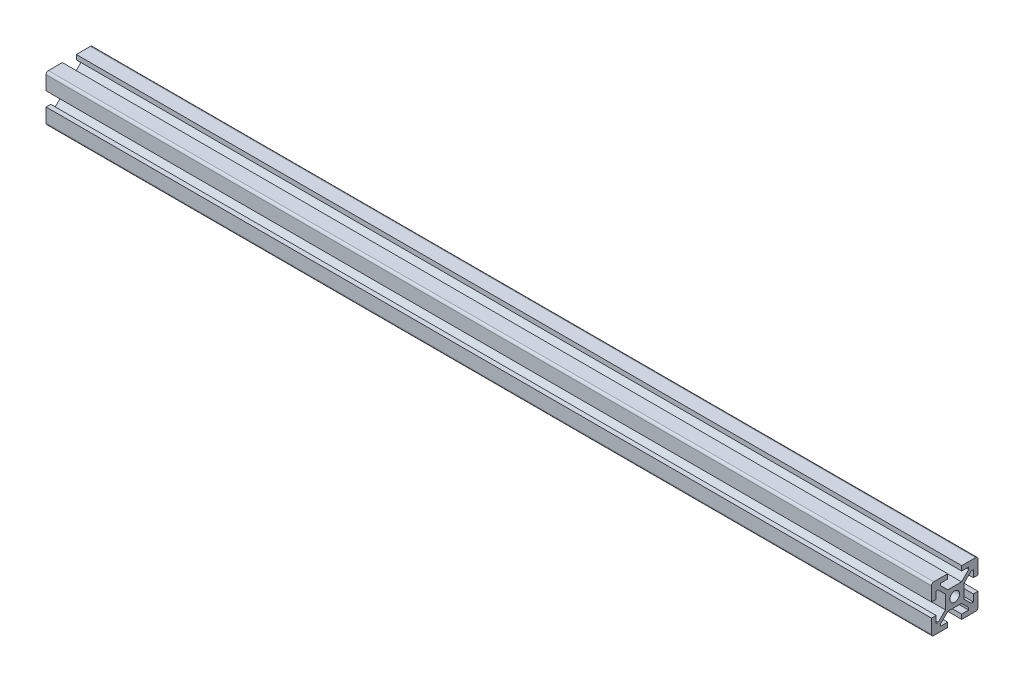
ISO-10303-21;
HEADER;
FILE_DESCRIPTION(('STEP AP214'),'2;1');
FILE_NAME('part.step','',(''),(''),'','','');
FILE_SCHEMA(('AUTOMOTIVE_DESIGN { 1 0 10303 214 1 1 1 1 }'));
ENDSEC;
DATA;
#1=APPLICATION_CONTEXT('core data for automotive mechanical design processes');
#2=APPLICATION_PROTOCOL_DEFINITION('international standard','automotive_design',2000,#1);
#3=PRODUCT_CONTEXT('',#1,'mechanical');
#4=PRODUCT('Part','Part','',(#3));
#5=PRODUCT_RELATED_PRODUCT_CATEGORY('part','',(#4));
#6=PRODUCT_DEFINITION_FORMATION('','',#4);
#7=PRODUCT_DEFINITION_CONTEXT('part definition',#1,'design');
#8=PRODUCT_DEFINITION('design','',#6,#7);
#9=PRODUCT_DEFINITION_SHAPE('','',#8);
#10=(LENGTH_UNIT() NAMED_UNIT(*) SI_UNIT(.MILLI.,.METRE.));
#11=(NAMED_UNIT(*) PLANE_ANGLE_UNIT() SI_UNIT($,.RADIAN.));
#12=(NAMED_UNIT(*) SI_UNIT($,.STERADIAN.) SOLID_ANGLE_UNIT());
#13=UNCERTAINTY_MEASURE_WITH_UNIT(LENGTH_MEASURE(1.E-05),#10,'distance_accuracy_value','');
#14=(GEOMETRIC_REPRESENTATION_CONTEXT(3) GLOBAL_UNCERTAINTY_ASSIGNED_CONTEXT((#13)) GLOBAL_UNIT_ASSIGNED_CONTEXT((#10,
#11,#12)) REPRESENTATION_CONTEXT('',''));
#15=CARTESIAN_POINT('',(0.,0.,0.));
#16=DIRECTION('',(0.,0.,1.));
#17=DIRECTION('',(1.,0.,0.));
#18=AXIS2_PLACEMENT_3D('',#15,#16,#17);
#19=CARTESIAN_POINT('',(380.,9.,9.));
#20=DIRECTION('',(1.,0.,0.));
#21=DIRECTION('',(0.,0.,-1.));
#22=AXIS2_PLACEMENT_3D('',#19,#20,#21);
#23=PLANE('',#22);
#24=CARTESIAN_POINT('',(380.,9.,9.));
#25=DIRECTION('',(1.,0.,0.));
#26=DIRECTION('',(0.,0.,-1.));
#27=AXIS2_PLACEMENT_3D('',#24,#25,#26);
#28=CIRCLE('',#27,1.);
#29=CARTESIAN_POINT('',(380.,10.,9.));
#30=VERTEX_POINT('',#29);
#31=CARTESIAN_POINT('',(380.,9.,10.));
#32=VERTEX_POINT('',#31);
#33=EDGE_CURVE('E467',#30,#32,#28,.T.);
#34=ORIENTED_EDGE('',*,*,#33,.T.);
#35=DIRECTION('',(0.,-1.,0.));
#36=VECTOR('',#35,1.);
#37=CARTESIAN_POINT('',(380.,9.,10.));
#38=LINE('',#37,#36);
#39=CARTESIAN_POINT('',(380.,3.,10.));
#40=VERTEX_POINT('',#39);
#41=EDGE_CURVE('E215',#32,#40,#38,.T.);
#42=ORIENTED_EDGE('',*,*,#41,.T.);
#43=DIRECTION('',(0.,0.,-1.));
#44=VECTOR('',#43,1.);
#45=CARTESIAN_POINT('',(380.,3.,10.));
#46=LINE('',#45,#44);
#47=CARTESIAN_POINT('',(380.,3.,8.));
#48=VERTEX_POINT('',#47);
#49=EDGE_CURVE('E602',#40,#48,#46,.T.);
#50=ORIENTED_EDGE('',*,*,#49,.T.);
#51=DIRECTION('',(0.,1.,0.));
#52=VECTOR('',#51,1.);
#53=CARTESIAN_POINT('',(380.,3.,8.));
#54=LINE('',#53,#52);
#55=CARTESIAN_POINT('',(380.,6.,8.));
#56=VERTEX_POINT('',#55);
#57=EDGE_CURVE('E621',#48,#56,#54,.T.);
#58=ORIENTED_EDGE('',*,*,#57,.T.);
#59=DIRECTION('',(0.,0.,-1.));
#60=VECTOR('',#59,1.);
#61=CARTESIAN_POINT('',(380.,6.,8.));
#62=LINE('',#61,#60);
#63=CARTESIAN_POINT('',(380.,6.,7.06066017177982));
#64=VERTEX_POINT('',#63);
#65=EDGE_CURVE('E618',#56,#64,#62,.T.);
#66=ORIENTED_EDGE('',*,*,#65,.T.);
#67=DIRECTION('',(0.,-0.707106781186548,-0.707106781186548));
#68=VECTOR('',#67,1.);
#69=CARTESIAN_POINT('',(380.,6.,7.06066017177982));
#70=LINE('',#69,#68);
#71=CARTESIAN_POINT('',(380.,2.93933982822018,4.));
#72=VERTEX_POINT('',#71);
#73=EDGE_CURVE('E620',#64,#72,#70,.T.);
#74=ORIENTED_EDGE('',*,*,#73,.T.);
#75=DIRECTION('',(0.,-1.,0.));
#76=VECTOR('',#75,1.);
#77=CARTESIAN_POINT('',(380.,2.93933982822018,4.));
#78=LINE('',#77,#76);
#79=CARTESIAN_POINT('',(380.,-2.93933982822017,4.));
#80=VERTEX_POINT('',#79);
#81=EDGE_CURVE('E623',#72,#80,#78,.T.);
#82=ORIENTED_EDGE('',*,*,#81,.T.);
#83=DIRECTION('',(0.,-0.707106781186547,0.707106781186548));
#84=VECTOR('',#83,1.);
#85=CARTESIAN_POINT('',(380.,-2.93933982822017,4.));
#86=LINE('',#85,#84);
#87=CARTESIAN_POINT('',(380.,-6.,7.06066017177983));
#88=VERTEX_POINT('',#87);
#89=EDGE_CURVE('E629',#80,#88,#86,.T.);
#90=ORIENTED_EDGE('',*,*,#89,.T.);
#91=DIRECTION('',(0.,0.,1.));
#92=VECTOR('',#91,1.);
#93=CARTESIAN_POINT('',(380.,-6.,7.06066017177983));
#94=LINE('',#93,#92);
#95=CARTESIAN_POINT('',(380.,-6.,7.99999999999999));
#96=VERTEX_POINT('',#95);
#97=EDGE_CURVE('E631',#88,#96,#94,.T.);
#98=ORIENTED_EDGE('',*,*,#97,.T.);
#99=DIRECTION('',(0.,1.,0.));
#100=VECTOR('',#99,1.);
#101=CARTESIAN_POINT('',(380.,-6.,7.99999999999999));
#102=LINE('',#101,#100);
#103=CARTESIAN_POINT('',(380.,-3.,7.99999999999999));
#104=VERTEX_POINT('',#103);
#105=EDGE_CURVE('E633',#96,#104,#102,.T.);
#106=ORIENTED_EDGE('',*,*,#105,.T.);
#107=DIRECTION('',(0.,0.,1.));
#108=VECTOR('',#107,1.);
#109=CARTESIAN_POINT('',(380.,-3.,7.99999999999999));
#110=LINE('',#109,#108);
#111=CARTESIAN_POINT('',(380.,-3.,10.));
#112=VERTEX_POINT('',#111);
#113=EDGE_CURVE('E635',#104,#112,#110,.T.);
#114=ORIENTED_EDGE('',*,*,#113,.T.);
#115=DIRECTION('',(0.,-1.,0.));
#116=VECTOR('',#115,1.);
#117=CARTESIAN_POINT('',(380.,-3.,10.));
#118=LINE('',#117,#116);
#119=CARTESIAN_POINT('',(380.,-9.,10.));
#120=VERTEX_POINT('',#119);
#121=EDGE_CURVE('E637',#112,#120,#118,.T.);
#122=ORIENTED_EDGE('',*,*,#121,.T.);
#123=CARTESIAN_POINT('',(380.,-9.,9.));
#124=DIRECTION('',(1.,0.,0.));
#125=DIRECTION('',(0.,0.,-1.));
#126=AXIS2_PLACEMENT_3D('',#123,#124,#125);
#127=CIRCLE('',#126,1.);
#128=CARTESIAN_POINT('',(380.,-10.,9.));
#129=VERTEX_POINT('',#128);
#130=EDGE_CURVE('E639',#120,#129,#127,.T.);
#131=ORIENTED_EDGE('',*,*,#130,.T.);
#132=DIRECTION('',(0.,0.,-1.));
#133=VECTOR('',#132,1.);
#134=CARTESIAN_POINT('',(380.,-10.,9.));
#135=LINE('',#134,#133);
#136=CARTESIAN_POINT('',(380.,-10.,3.));
#137=VERTEX_POINT('',#136);
#138=EDGE_CURVE('E641',#129,#137,#135,.T.);
#139=ORIENTED_EDGE('',*,*,#138,.T.);
#140=DIRECTION('',(0.,1.,0.));
#141=VECTOR('',#140,1.);
#142=CARTESIAN_POINT('',(380.,-10.,3.));
#143=LINE('',#142,#141);
#144=CARTESIAN_POINT('',(380.,-8.,3.));
#145=VERTEX_POINT('',#144);
#146=EDGE_CURVE('E643',#137,#145,#143,.T.);
#147=ORIENTED_EDGE('',*,*,#146,.T.);
#148=DIRECTION('',(0.,0.,1.));
#149=VECTOR('',#148,1.);
#150=CARTESIAN_POINT('',(380.,-8.,3.));
#151=LINE('',#150,#149);
#152=CARTESIAN_POINT('',(380.,-8.,6.));
#153=VERTEX_POINT('',#152);
#154=EDGE_CURVE('E645',#145,#153,#151,.T.);
#155=ORIENTED_EDGE('',*,*,#154,.T.);
#156=DIRECTION('',(0.,1.,0.));
#157=VECTOR('',#156,1.);
#158=CARTESIAN_POINT('',(380.,-8.,6.));
#159=LINE('',#158,#157);
#160=CARTESIAN_POINT('',(380.,-7.06066017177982,6.));
#161=VERTEX_POINT('',#160);
#162=EDGE_CURVE('E647',#153,#161,#159,.T.);
#163=ORIENTED_EDGE('',*,*,#162,.T.);
#164=DIRECTION('',(0.,0.707106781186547,-0.707106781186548));
#165=VECTOR('',#164,1.);
#166=CARTESIAN_POINT('',(380.,-7.06066017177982,6.));
#167=LINE('',#166,#165);
#168=CARTESIAN_POINT('',(380.,-4.,2.93933982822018));
#169=VERTEX_POINT('',#168);
#170=EDGE_CURVE('E649',#161,#169,#167,.T.);
#171=ORIENTED_EDGE('',*,*,#170,.T.);
#172=DIRECTION('',(0.,0.,-1.));
#173=VECTOR('',#172,1.);
#174=CARTESIAN_POINT('',(380.,-4.,2.93933982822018));
#175=LINE('',#174,#173);
#176=CARTESIAN_POINT('',(380.,-4.,-2.93933982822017));
#177=VERTEX_POINT('',#176);
#178=EDGE_CURVE('E651',#169,#177,#175,.T.);
#179=ORIENTED_EDGE('',*,*,#178,.T.);
#180=DIRECTION('',(0.,-0.707106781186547,-0.707106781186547));
#181=VECTOR('',#180,1.);
#182=CARTESIAN_POINT('',(380.,-4.,-2.93933982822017));
#183=LINE('',#182,#181);
#184=CARTESIAN_POINT('',(380.,-7.06066017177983,-6.));
#185=VERTEX_POINT('',#184);
#186=EDGE_CURVE('E653',#177,#185,#183,.T.);
#187=ORIENTED_EDGE('',*,*,#186,.T.);
#188=DIRECTION('',(0.,-1.,0.));
#189=VECTOR('',#188,1.);
#190=CARTESIAN_POINT('',(380.,-7.06066017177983,-6.));
#191=LINE('',#190,#189);
#192=CARTESIAN_POINT('',(380.,-7.99999999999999,-6.));
#193=VERTEX_POINT('',#192);
#194=EDGE_CURVE('E655',#185,#193,#191,.T.);
#195=ORIENTED_EDGE('',*,*,#194,.T.);
#196=DIRECTION('',(0.,0.,1.));
#197=VECTOR('',#196,1.);
#198=CARTESIAN_POINT('',(380.,-7.99999999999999,-6.));
#199=LINE('',#198,#197);
#200=CARTESIAN_POINT('',(380.,-7.99999999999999,-3.));
#201=VERTEX_POINT('',#200);
#202=EDGE_CURVE('E657',#193,#201,#199,.T.);
#203=ORIENTED_EDGE('',*,*,#202,.T.);
#204=DIRECTION('',(0.,-1.,0.));
#205=VECTOR('',#204,1.);
#206=CARTESIAN_POINT('',(380.,-7.99999999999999,-3.));
#207=LINE('',#206,#205);
#208=CARTESIAN_POINT('',(380.,-10.,-3.));
#209=VERTEX_POINT('',#208);
#210=EDGE_CURVE('E659',#201,#209,#207,.T.);
#211=ORIENTED_EDGE('',*,*,#210,.T.);
#212=DIRECTION('',(0.,0.,-1.));
#213=VECTOR('',#212,1.);
#214=CARTESIAN_POINT('',(380.,-10.,-3.));
#215=LINE('',#214,#213);
#216=CARTESIAN_POINT('',(380.,-10.,-9.00000000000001));
#217=VERTEX_POINT('',#216);
#218=EDGE_CURVE('E661',#209,#217,#215,.T.);
#219=ORIENTED_EDGE('',*,*,#218,.T.);
#220=CARTESIAN_POINT('',(380.,-9.,-9.00000000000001));
#221=DIRECTION('',(1.,0.,0.));
#222=DIRECTION('',(0.,0.,-1.));
#223=AXIS2_PLACEMENT_3D('',#220,#221,#222);
#224=CIRCLE('',#223,0.999999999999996);
#225=CARTESIAN_POINT('',(380.,-9.,-10.));
#226=VERTEX_POINT('',#225);
#227=EDGE_CURVE('E663',#217,#226,#224,.T.);
#228=ORIENTED_EDGE('',*,*,#227,.T.);
#229=DIRECTION('',(0.,1.,0.));
#230=VECTOR('',#229,1.);
#231=CARTESIAN_POINT('',(380.,-9.,-10.));
#232=LINE('',#231,#230);
#233=CARTESIAN_POINT('',(380.,-3.,-10.));
#234=VERTEX_POINT('',#233);
#235=EDGE_CURVE('E665',#226,#234,#232,.T.);
#236=ORIENTED_EDGE('',*,*,#235,.T.);
#237=DIRECTION('',(0.,0.,1.));
#238=VECTOR('',#237,1.);
#239=CARTESIAN_POINT('',(380.,-3.,-10.));
#240=LINE('',#239,#238);
#241=CARTESIAN_POINT('',(380.,-3.,-8.00000000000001));
#242=VERTEX_POINT('',#241);
#243=EDGE_CURVE('E667',#234,#242,#240,.T.);
#244=ORIENTED_EDGE('',*,*,#243,.T.);
#245=DIRECTION('',(0.,-1.,0.));
#246=VECTOR('',#245,1.);
#247=CARTESIAN_POINT('',(380.,-3.,-8.00000000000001));
#248=LINE('',#247,#246);
#249=CARTESIAN_POINT('',(380.,-6.,-8.00000000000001));
#250=VERTEX_POINT('',#249);
#251=EDGE_CURVE('E669',#242,#250,#248,.T.);
#252=ORIENTED_EDGE('',*,*,#251,.T.);
#253=DIRECTION('',(0.,0.,1.));
#254=VECTOR('',#253,1.);
#255=CARTESIAN_POINT('',(380.,-6.,-8.00000000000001));
#256=LINE('',#255,#254);
#257=CARTESIAN_POINT('',(380.,-6.,-7.06066017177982));
#258=VERTEX_POINT('',#257);
#259=EDGE_CURVE('E671',#250,#258,#256,.T.);
#260=ORIENTED_EDGE('',*,*,#259,.T.);
#261=DIRECTION('',(0.,0.707106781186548,0.707106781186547));
#262=VECTOR('',#261,1.);
#263=CARTESIAN_POINT('',(380.,-6.,-7.06066017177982));
#264=LINE('',#263,#262);
#265=CARTESIAN_POINT('',(380.,-2.93933982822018,-4.));
#266=VERTEX_POINT('',#265);
#267=EDGE_CURVE('E673',#258,#266,#264,.T.);
#268=ORIENTED_EDGE('',*,*,#267,.T.);
#269=DIRECTION('',(0.,1.,0.));
#270=VECTOR('',#269,1.);
#271=CARTESIAN_POINT('',(380.,-2.93933982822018,-4.));
#272=LINE('',#271,#270);
#273=CARTESIAN_POINT('',(380.,2.93933982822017,-4.));
#274=VERTEX_POINT('',#273);
#275=EDGE_CURVE('E675',#266,#274,#272,.T.);
#276=ORIENTED_EDGE('',*,*,#275,.T.);
#277=DIRECTION('',(0.,0.707106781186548,-0.707106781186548));
#278=VECTOR('',#277,1.);
#279=CARTESIAN_POINT('',(380.,2.93933982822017,-4.));
#280=LINE('',#279,#278);
#281=CARTESIAN_POINT('',(380.,6.,-7.06066017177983));
#282=VERTEX_POINT('',#281);
#283=EDGE_CURVE('E677',#274,#282,#280,.T.);
#284=ORIENTED_EDGE('',*,*,#283,.T.);
#285=DIRECTION('',(0.,0.,-1.));
#286=VECTOR('',#285,1.);
#287=CARTESIAN_POINT('',(380.,6.,-7.06066017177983));
#288=LINE('',#287,#286);
#289=CARTESIAN_POINT('',(380.,6.,-7.99999999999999));
#290=VERTEX_POINT('',#289);
#291=EDGE_CURVE('E679',#282,#290,#288,.T.);
#292=ORIENTED_EDGE('',*,*,#291,.T.);
#293=DIRECTION('',(0.,-1.,0.));
#294=VECTOR('',#293,1.);
#295=CARTESIAN_POINT('',(380.,6.,-7.99999999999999));
#296=LINE('',#295,#294);
#297=CARTESIAN_POINT('',(380.,3.,-7.99999999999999));
#298=VERTEX_POINT('',#297);
#299=EDGE_CURVE('E681',#290,#298,#296,.T.);
#300=ORIENTED_EDGE('',*,*,#299,.T.);
#301=DIRECTION('',(0.,0.,-1.));
#302=VECTOR('',#301,1.);
#303=CARTESIAN_POINT('',(380.,3.,-7.99999999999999));
#304=LINE('',#303,#302);
#305=CARTESIAN_POINT('',(380.,3.,-10.));
#306=VERTEX_POINT('',#305);
#307=EDGE_CURVE('E683',#298,#306,#304,.T.);
#308=ORIENTED_EDGE('',*,*,#307,.T.);
#309=DIRECTION('',(0.,1.,0.));
#310=VECTOR('',#309,1.);
#311=CARTESIAN_POINT('',(380.,3.,-10.));
#312=LINE('',#311,#310);
#313=CARTESIAN_POINT('',(380.,9.,-10.));
#314=VERTEX_POINT('',#313);
#315=EDGE_CURVE('E685',#306,#314,#312,.T.);
#316=ORIENTED_EDGE('',*,*,#315,.T.);
#317=CARTESIAN_POINT('',(380.,9.,-9.00000000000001));
#318=DIRECTION('',(1.,0.,0.));
#319=DIRECTION('',(0.,0.,-1.));
#320=AXIS2_PLACEMENT_3D('',#317,#318,#319);
#321=CIRCLE('',#320,1.);
#322=CARTESIAN_POINT('',(380.,10.,-9.00000000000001));
#323=VERTEX_POINT('',#322);
#324=EDGE_CURVE('E687',#314,#323,#321,.T.);
#325=ORIENTED_EDGE('',*,*,#324,.T.);
#326=DIRECTION('',(0.,0.,1.));
#327=VECTOR('',#326,1.);
#328=CARTESIAN_POINT('',(380.,10.,-9.00000000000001));
#329=LINE('',#328,#327);
#330=CARTESIAN_POINT('',(380.,10.,-3.));
#331=VERTEX_POINT('',#330);
#332=EDGE_CURVE('E689',#323,#331,#329,.T.);
#333=ORIENTED_EDGE('',*,*,#332,.T.);
#334=DIRECTION('',(0.,-1.,0.));
#335=VECTOR('',#334,1.);
#336=CARTESIAN_POINT('',(380.,10.,-3.));
#337=LINE('',#336,#335);
#338=CARTESIAN_POINT('',(380.,8.,-3.));
#339=VERTEX_POINT('',#338);
#340=EDGE_CURVE('E691',#331,#339,#337,.T.);
#341=ORIENTED_EDGE('',*,*,#340,.T.);
#342=DIRECTION('',(0.,0.,-1.));
#343=VECTOR('',#342,1.);
#344=CARTESIAN_POINT('',(380.,8.,-3.));
#345=LINE('',#344,#343);
#346=CARTESIAN_POINT('',(380.,8.,-6.));
#347=VERTEX_POINT('',#346);
#348=EDGE_CURVE('E693',#339,#347,#345,.T.);
#349=ORIENTED_EDGE('',*,*,#348,.T.);
#350=DIRECTION('',(0.,-1.,0.));
#351=VECTOR('',#350,1.);
#352=CARTESIAN_POINT('',(380.,8.,-6.));
#353=LINE('',#352,#351);
#354=CARTESIAN_POINT('',(380.,7.06066017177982,-6.));
#355=VERTEX_POINT('',#354);
#356=EDGE_CURVE('E695',#347,#355,#353,.T.);
#357=ORIENTED_EDGE('',*,*,#356,.T.);
#358=DIRECTION('',(0.,-0.707106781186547,0.707106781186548));
#359=VECTOR('',#358,1.);
#360=CARTESIAN_POINT('',(380.,7.06066017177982,-6.));
#361=LINE('',#360,#359);
#362=CARTESIAN_POINT('',(380.,4.,-2.93933982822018));
#363=VERTEX_POINT('',#362);
#364=EDGE_CURVE('E697',#355,#363,#361,.T.);
#365=ORIENTED_EDGE('',*,*,#364,.T.);
#366=DIRECTION('',(0.,0.,1.));
#367=VECTOR('',#366,1.);
#368=CARTESIAN_POINT('',(380.,4.,-2.93933982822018));
#369=LINE('',#368,#367);
#370=CARTESIAN_POINT('',(380.,4.,2.93933982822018));
#371=VERTEX_POINT('',#370);
#372=EDGE_CURVE('E699',#363,#371,#369,.T.);
#373=ORIENTED_EDGE('',*,*,#372,.T.);
#374=DIRECTION('',(0.,0.707106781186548,0.707106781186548));
#375=VECTOR('',#374,1.);
#376=CARTESIAN_POINT('',(380.,4.,2.93933982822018));
#377=LINE('',#376,#375);
#378=CARTESIAN_POINT('',(380.,7.06066017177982,6.));
#379=VERTEX_POINT('',#378);
#380=EDGE_CURVE('E701',#371,#379,#377,.T.);
#381=ORIENTED_EDGE('',*,*,#380,.T.);
#382=DIRECTION('',(0.,1.,0.));
#383=VECTOR('',#382,1.);
#384=CARTESIAN_POINT('',(380.,7.06066017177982,6.));
#385=LINE('',#384,#383);
#386=CARTESIAN_POINT('',(380.,7.99999999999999,6.));
#387=VERTEX_POINT('',#386);
#388=EDGE_CURVE('E354',#379,#387,#385,.T.);
#389=ORIENTED_EDGE('',*,*,#388,.T.);
#390=DIRECTION('',(0.,0.,-1.));
#391=VECTOR('',#390,1.);
#392=CARTESIAN_POINT('',(380.,7.99999999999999,6.));
#393=LINE('',#392,#391);
#394=CARTESIAN_POINT('',(380.,7.99999999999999,3.));
#395=VERTEX_POINT('',#394);
#396=EDGE_CURVE('E348',#387,#395,#393,.T.);
#397=ORIENTED_EDGE('',*,*,#396,.T.);
#398=DIRECTION('',(0.,1.,0.));
#399=VECTOR('',#398,1.);
#400=CARTESIAN_POINT('',(380.,7.99999999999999,3.));
#401=LINE('',#400,#399);
#402=CARTESIAN_POINT('',(380.,10.,3.));
#403=VERTEX_POINT('',#402);
#404=EDGE_CURVE('E352',#395,#403,#401,.T.);
#405=ORIENTED_EDGE('',*,*,#404,.T.);
#406=DIRECTION('',(0.,0.,1.));
#407=VECTOR('',#406,1.);
#408=CARTESIAN_POINT('',(380.,10.,3.));
#409=LINE('',#408,#407);
#410=EDGE_CURVE('E52',#403,#30,#409,.T.);
#411=ORIENTED_EDGE('',*,*,#410,.T.);
#412=EDGE_LOOP('',(#34,#42,#50,#58,#66,#74,#82,#90,#98,#106,#114,#122,#131,#139,#147,#155,#163,
#171,#179,#187,#195,#203,#211,#219,#228,#236,#244,#252,#260,#268,#276,#284,#292,#300,#308,#316,
#325,#333,#341,#349,#357,#365,#373,#381,#389,#397,#405,#411));
#413=FACE_BOUND('',#412,.T.);
#414=CARTESIAN_POINT('',(380.,0.,0.));
#415=DIRECTION('',(1.,0.,0.));
#416=DIRECTION('',(0.,0.,-1.));
#417=AXIS2_PLACEMENT_3D('',#414,#415,#416);
#418=CIRCLE('',#417,2.1);
#419=CARTESIAN_POINT('',(380.,0.,-2.1));
#420=VERTEX_POINT('',#419);
#421=EDGE_CURVE('E376',#420,#420,#418,.T.);
#422=ORIENTED_EDGE('',*,*,#421,.F.);
#423=EDGE_LOOP('',(#422));
#424=FACE_BOUND('',#423,.T.);
#425=ADVANCED_FACE('F35',(#413,#424),#23,.T.);
#426=CARTESIAN_POINT('',(0.,9.,9.));
#427=DIRECTION('',(1.,0.,0.));
#428=DIRECTION('',(0.,0.,-1.));
#429=AXIS2_PLACEMENT_3D('',#426,#427,#428);
#430=PLANE('',#429);
#431=CARTESIAN_POINT('',(0.,9.,9.));
#432=DIRECTION('',(1.,0.,0.));
#433=DIRECTION('',(0.,0.,-1.));
#434=AXIS2_PLACEMENT_3D('',#431,#432,#433);
#435=CIRCLE('',#434,1.);
#436=CARTESIAN_POINT('',(0.,10.,9.));
#437=VERTEX_POINT('',#436);
#438=CARTESIAN_POINT('',(0.,9.,10.));
#439=VERTEX_POINT('',#438);
#440=EDGE_CURVE('E372',#437,#439,#435,.T.);
#441=ORIENTED_EDGE('',*,*,#440,.F.);
#442=DIRECTION('',(0.,0.,1.));
#443=VECTOR('',#442,1.);
#444=CARTESIAN_POINT('',(0.,10.,3.));
#445=LINE('',#444,#443);
#446=CARTESIAN_POINT('',(0.,10.,3.));
#447=VERTEX_POINT('',#446);
#448=EDGE_CURVE('E207',#447,#437,#445,.T.);
#449=ORIENTED_EDGE('',*,*,#448,.F.);
#450=DIRECTION('',(0.,1.,0.));
#451=VECTOR('',#450,1.);
#452=CARTESIAN_POINT('',(0.,7.99999999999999,3.));
#453=LINE('',#452,#451);
#454=CARTESIAN_POINT('',(0.,7.99999999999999,3.));
#455=VERTEX_POINT('',#454);
#456=EDGE_CURVE('E201',#455,#447,#453,.T.);
#457=ORIENTED_EDGE('',*,*,#456,.F.);
#458=DIRECTION('',(0.,0.,-1.));
#459=VECTOR('',#458,1.);
#460=CARTESIAN_POINT('',(0.,7.99999999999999,6.));
#461=LINE('',#460,#459);
#462=CARTESIAN_POINT('',(0.,7.99999999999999,6.));
#463=VERTEX_POINT('',#462);
#464=EDGE_CURVE('E362',#463,#455,#461,.T.);
#465=ORIENTED_EDGE('',*,*,#464,.F.);
#466=DIRECTION('',(0.,1.,0.));
#467=VECTOR('',#466,1.);
#468=CARTESIAN_POINT('',(0.,7.06066017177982,6.));
#469=LINE('',#468,#467);
#470=CARTESIAN_POINT('',(0.,7.06066017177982,6.));
#471=VERTEX_POINT('',#470);
#472=EDGE_CURVE('E462',#471,#463,#469,.T.);
#473=ORIENTED_EDGE('',*,*,#472,.F.);
#474=DIRECTION('',(0.,0.707106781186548,0.707106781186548));
#475=VECTOR('',#474,1.);
#476=CARTESIAN_POINT('',(0.,4.,2.93933982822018));
#477=LINE('',#476,#475);
#478=CARTESIAN_POINT('',(0.,4.,2.93933982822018));
#479=VERTEX_POINT('',#478);
#480=EDGE_CURVE('E460',#479,#471,#477,.T.);
#481=ORIENTED_EDGE('',*,*,#480,.F.);
#482=DIRECTION('',(0.,0.,1.));
#483=VECTOR('',#482,1.);
#484=CARTESIAN_POINT('',(0.,4.,-2.93933982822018));
#485=LINE('',#484,#483);
#486=CARTESIAN_POINT('',(0.,4.,-2.93933982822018));
#487=VERTEX_POINT('',#486);
#488=EDGE_CURVE('E458',#487,#479,#485,.T.);
#489=ORIENTED_EDGE('',*,*,#488,.F.);
#490=DIRECTION('',(0.,-0.707106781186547,0.707106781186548));
#491=VECTOR('',#490,1.);
#492=CARTESIAN_POINT('',(0.,7.06066017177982,-6.));
#493=LINE('',#492,#491);
#494=CARTESIAN_POINT('',(0.,7.06066017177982,-6.));
#495=VERTEX_POINT('',#494);
#496=EDGE_CURVE('E456',#495,#487,#493,.T.);
#497=ORIENTED_EDGE('',*,*,#496,.F.);
#498=DIRECTION('',(0.,-1.,0.));
#499=VECTOR('',#498,1.);
#500=CARTESIAN_POINT('',(0.,8.,-6.));
#501=LINE('',#500,#499);
#502=CARTESIAN_POINT('',(0.,8.,-6.));
#503=VERTEX_POINT('',#502);
#504=EDGE_CURVE('E454',#503,#495,#501,.T.);
#505=ORIENTED_EDGE('',*,*,#504,.F.);
#506=DIRECTION('',(0.,0.,-1.));
#507=VECTOR('',#506,1.);
#508=CARTESIAN_POINT('',(0.,8.,-3.));
#509=LINE('',#508,#507);
#510=CARTESIAN_POINT('',(0.,8.,-3.));
#511=VERTEX_POINT('',#510);
#512=EDGE_CURVE('E452',#511,#503,#509,.T.);
#513=ORIENTED_EDGE('',*,*,#512,.F.);
#514=DIRECTION('',(0.,-1.,0.));
#515=VECTOR('',#514,1.);
#516=CARTESIAN_POINT('',(0.,10.,-3.));
#517=LINE('',#516,#515);
#518=CARTESIAN_POINT('',(0.,10.,-3.));
#519=VERTEX_POINT('',#518);
#520=EDGE_CURVE('E450',#519,#511,#517,.T.);
#521=ORIENTED_EDGE('',*,*,#520,.F.);
#522=DIRECTION('',(0.,0.,1.));
#523=VECTOR('',#522,1.);
#524=CARTESIAN_POINT('',(0.,10.,-9.00000000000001));
#525=LINE('',#524,#523);
#526=CARTESIAN_POINT('',(0.,10.,-9.00000000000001));
#527=VERTEX_POINT('',#526);
#528=EDGE_CURVE('E448',#527,#519,#525,.T.);
#529=ORIENTED_EDGE('',*,*,#528,.F.);
#530=CARTESIAN_POINT('',(0.,9.,-9.00000000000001));
#531=DIRECTION('',(1.,0.,0.));
#532=DIRECTION('',(0.,0.,-1.));
#533=AXIS2_PLACEMENT_3D('',#530,#531,#532);
#534=CIRCLE('',#533,1.);
#535=CARTESIAN_POINT('',(0.,9.,-10.));
#536=VERTEX_POINT('',#535);
#537=EDGE_CURVE('E446',#536,#527,#534,.T.);
#538=ORIENTED_EDGE('',*,*,#537,.F.);
#539=DIRECTION('',(0.,1.,0.));
#540=VECTOR('',#539,1.);
#541=CARTESIAN_POINT('',(0.,3.,-10.));
#542=LINE('',#541,#540);
#543=CARTESIAN_POINT('',(0.,3.,-10.));
#544=VERTEX_POINT('',#543);
#545=EDGE_CURVE('E444',#544,#536,#542,.T.);
#546=ORIENTED_EDGE('',*,*,#545,.F.);
#547=DIRECTION('',(0.,0.,-1.));
#548=VECTOR('',#547,1.);
#549=CARTESIAN_POINT('',(0.,3.,-7.99999999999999));
#550=LINE('',#549,#548);
#551=CARTESIAN_POINT('',(0.,3.,-7.99999999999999));
#552=VERTEX_POINT('',#551);
#553=EDGE_CURVE('E442',#552,#544,#550,.T.);
#554=ORIENTED_EDGE('',*,*,#553,.F.);
#555=DIRECTION('',(0.,-1.,0.));
#556=VECTOR('',#555,1.);
#557=CARTESIAN_POINT('',(0.,6.,-7.99999999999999));
#558=LINE('',#557,#556);
#559=CARTESIAN_POINT('',(0.,6.,-7.99999999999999));
#560=VERTEX_POINT('',#559);
#561=EDGE_CURVE('E440',#560,#552,#558,.T.);
#562=ORIENTED_EDGE('',*,*,#561,.F.);
#563=DIRECTION('',(0.,0.,-1.));
#564=VECTOR('',#563,1.);
#565=CARTESIAN_POINT('',(0.,6.,-7.06066017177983));
#566=LINE('',#565,#564);
#567=CARTESIAN_POINT('',(0.,6.,-7.06066017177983));
#568=VERTEX_POINT('',#567);
#569=EDGE_CURVE('E438',#568,#560,#566,.T.);
#570=ORIENTED_EDGE('',*,*,#569,.F.);
#571=DIRECTION('',(0.,0.707106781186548,-0.707106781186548));
#572=VECTOR('',#571,1.);
#573=CARTESIAN_POINT('',(0.,2.93933982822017,-4.));
#574=LINE('',#573,#572);
#575=CARTESIAN_POINT('',(0.,2.93933982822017,-4.));
#576=VERTEX_POINT('',#575);
#577=EDGE_CURVE('E436',#576,#568,#574,.T.);
#578=ORIENTED_EDGE('',*,*,#577,.F.);
#579=DIRECTION('',(0.,1.,0.));
#580=VECTOR('',#579,1.);
#581=CARTESIAN_POINT('',(0.,-2.93933982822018,-4.));
#582=LINE('',#581,#580);
#583=CARTESIAN_POINT('',(0.,-2.93933982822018,-4.));
#584=VERTEX_POINT('',#583);
#585=EDGE_CURVE('E434',#584,#576,#582,.T.);
#586=ORIENTED_EDGE('',*,*,#585,.F.);
#587=DIRECTION('',(0.,0.707106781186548,0.707106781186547));
#588=VECTOR('',#587,1.);
#589=CARTESIAN_POINT('',(0.,-6.,-7.06066017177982));
#590=LINE('',#589,#588);
#591=CARTESIAN_POINT('',(0.,-6.,-7.06066017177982));
#592=VERTEX_POINT('',#591);
#593=EDGE_CURVE('E432',#592,#584,#590,.T.);
#594=ORIENTED_EDGE('',*,*,#593,.F.);
#595=DIRECTION('',(0.,0.,1.));
#596=VECTOR('',#595,1.);
#597=CARTESIAN_POINT('',(0.,-6.,-8.00000000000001));
#598=LINE('',#597,#596);
#599=CARTESIAN_POINT('',(0.,-6.,-8.00000000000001));
#600=VERTEX_POINT('',#599);
#601=EDGE_CURVE('E430',#600,#592,#598,.T.);
#602=ORIENTED_EDGE('',*,*,#601,.F.);
#603=DIRECTION('',(0.,-1.,0.));
#604=VECTOR('',#603,1.);
#605=CARTESIAN_POINT('',(0.,-3.,-8.00000000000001));
#606=LINE('',#605,#604);
#607=CARTESIAN_POINT('',(0.,-3.,-8.00000000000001));
#608=VERTEX_POINT('',#607);
#609=EDGE_CURVE('E428',#608,#600,#606,.T.);
#610=ORIENTED_EDGE('',*,*,#609,.F.);
#611=DIRECTION('',(0.,0.,1.));
#612=VECTOR('',#611,1.);
#613=CARTESIAN_POINT('',(0.,-3.,-10.));
#614=LINE('',#613,#612);
#615=CARTESIAN_POINT('',(0.,-3.,-10.));
#616=VERTEX_POINT('',#615);
#617=EDGE_CURVE('E426',#616,#608,#614,.T.);
#618=ORIENTED_EDGE('',*,*,#617,.F.);
#619=DIRECTION('',(0.,1.,0.));
#620=VECTOR('',#619,1.);
#621=CARTESIAN_POINT('',(0.,-9.,-10.));
#622=LINE('',#621,#620);
#623=CARTESIAN_POINT('',(0.,-9.,-10.));
#624=VERTEX_POINT('',#623);
#625=EDGE_CURVE('E424',#624,#616,#622,.T.);
#626=ORIENTED_EDGE('',*,*,#625,.F.);
#627=CARTESIAN_POINT('',(0.,-9.,-9.00000000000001));
#628=DIRECTION('',(1.,0.,0.));
#629=DIRECTION('',(0.,0.,-1.));
#630=AXIS2_PLACEMENT_3D('',#627,#628,#629);
#631=CIRCLE('',#630,0.999999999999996);
#632=CARTESIAN_POINT('',(0.,-10.,-9.00000000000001));
#633=VERTEX_POINT('',#632);
#634=EDGE_CURVE('E422',#633,#624,#631,.T.);
#635=ORIENTED_EDGE('',*,*,#634,.F.);
#636=DIRECTION('',(0.,0.,-1.));
#637=VECTOR('',#636,1.);
#638=CARTESIAN_POINT('',(0.,-10.,-3.));
#639=LINE('',#638,#637);
#640=CARTESIAN_POINT('',(0.,-10.,-3.));
#641=VERTEX_POINT('',#640);
#642=EDGE_CURVE('E420',#641,#633,#639,.T.);
#643=ORIENTED_EDGE('',*,*,#642,.F.);
#644=DIRECTION('',(0.,-1.,0.));
#645=VECTOR('',#644,1.);
#646=CARTESIAN_POINT('',(0.,-7.99999999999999,-3.));
#647=LINE('',#646,#645);
#648=CARTESIAN_POINT('',(0.,-7.99999999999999,-3.));
#649=VERTEX_POINT('',#648);
#650=EDGE_CURVE('E418',#649,#641,#647,.T.);
#651=ORIENTED_EDGE('',*,*,#650,.F.);
#652=DIRECTION('',(0.,0.,1.));
#653=VECTOR('',#652,1.);
#654=CARTESIAN_POINT('',(0.,-7.99999999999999,-6.));
#655=LINE('',#654,#653);
#656=CARTESIAN_POINT('',(0.,-7.99999999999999,-6.));
#657=VERTEX_POINT('',#656);
#658=EDGE_CURVE('E416',#657,#649,#655,.T.);
#659=ORIENTED_EDGE('',*,*,#658,.F.);
#660=DIRECTION('',(0.,-1.,0.));
#661=VECTOR('',#660,1.);
#662=CARTESIAN_POINT('',(0.,-7.06066017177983,-6.));
#663=LINE('',#662,#661);
#664=CARTESIAN_POINT('',(0.,-7.06066017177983,-6.));
#665=VERTEX_POINT('',#664);
#666=EDGE_CURVE('E414',#665,#657,#663,.T.);
#667=ORIENTED_EDGE('',*,*,#666,.F.);
#668=DIRECTION('',(0.,-0.707106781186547,-0.707106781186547));
#669=VECTOR('',#668,1.);
#670=CARTESIAN_POINT('',(0.,-4.,-2.93933982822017));
#671=LINE('',#670,#669);
#672=CARTESIAN_POINT('',(0.,-4.,-2.93933982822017));
#673=VERTEX_POINT('',#672);
#674=EDGE_CURVE('E412',#673,#665,#671,.T.);
#675=ORIENTED_EDGE('',*,*,#674,.F.);
#676=DIRECTION('',(0.,0.,-1.));
#677=VECTOR('',#676,1.);
#678=CARTESIAN_POINT('',(0.,-4.,2.93933982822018));
#679=LINE('',#678,#677);
#680=CARTESIAN_POINT('',(0.,-4.,2.93933982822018));
#681=VERTEX_POINT('',#680);
#682=EDGE_CURVE('E410',#681,#673,#679,.T.);
#683=ORIENTED_EDGE('',*,*,#682,.F.);
#684=DIRECTION('',(0.,0.707106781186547,-0.707106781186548));
#685=VECTOR('',#684,1.);
#686=CARTESIAN_POINT('',(0.,-7.06066017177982,6.));
#687=LINE('',#686,#685);
#688=CARTESIAN_POINT('',(0.,-7.06066017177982,6.));
#689=VERTEX_POINT('',#688);
#690=EDGE_CURVE('E408',#689,#681,#687,.T.);
#691=ORIENTED_EDGE('',*,*,#690,.F.);
#692=DIRECTION('',(0.,1.,0.));
#693=VECTOR('',#692,1.);
#694=CARTESIAN_POINT('',(0.,-8.,6.));
#695=LINE('',#694,#693);
#696=CARTESIAN_POINT('',(0.,-8.,6.));
#697=VERTEX_POINT('',#696);
#698=EDGE_CURVE('E406',#697,#689,#695,.T.);
#699=ORIENTED_EDGE('',*,*,#698,.F.);
#700=DIRECTION('',(0.,0.,1.));
#701=VECTOR('',#700,1.);
#702=CARTESIAN_POINT('',(0.,-8.,3.));
#703=LINE('',#702,#701);
#704=CARTESIAN_POINT('',(0.,-8.,3.));
#705=VERTEX_POINT('',#704);
#706=EDGE_CURVE('E404',#705,#697,#703,.T.);
#707=ORIENTED_EDGE('',*,*,#706,.F.);
#708=DIRECTION('',(0.,1.,0.));
#709=VECTOR('',#708,1.);
#710=CARTESIAN_POINT('',(0.,-10.,3.));
#711=LINE('',#710,#709);
#712=CARTESIAN_POINT('',(0.,-10.,3.));
#713=VERTEX_POINT('',#712);
#714=EDGE_CURVE('E402',#713,#705,#711,.T.);
#715=ORIENTED_EDGE('',*,*,#714,.F.);
#716=DIRECTION('',(0.,0.,-1.));
#717=VECTOR('',#716,1.);
#718=CARTESIAN_POINT('',(0.,-10.,9.));
#719=LINE('',#718,#717);
#720=CARTESIAN_POINT('',(0.,-10.,9.));
#721=VERTEX_POINT('',#720);
#722=EDGE_CURVE('E400',#721,#713,#719,.T.);
#723=ORIENTED_EDGE('',*,*,#722,.F.);
#724=CARTESIAN_POINT('',(0.,-9.,9.));
#725=DIRECTION('',(1.,0.,0.));
#726=DIRECTION('',(0.,0.,-1.));
#727=AXIS2_PLACEMENT_3D('',#724,#725,#726);
#728=CIRCLE('',#727,1.);
#729=CARTESIAN_POINT('',(0.,-9.,10.));
#730=VERTEX_POINT('',#729);
#731=EDGE_CURVE('E398',#730,#721,#728,.T.);
#732=ORIENTED_EDGE('',*,*,#731,.F.);
#733=DIRECTION('',(0.,-1.,0.));
#734=VECTOR('',#733,1.);
#735=CARTESIAN_POINT('',(0.,-3.,10.));
#736=LINE('',#735,#734);
#737=CARTESIAN_POINT('',(0.,-3.,10.));
#738=VERTEX_POINT('',#737);
#739=EDGE_CURVE('E396',#738,#730,#736,.T.);
#740=ORIENTED_EDGE('',*,*,#739,.F.);
#741=DIRECTION('',(0.,0.,1.));
#742=VECTOR('',#741,1.);
#743=CARTESIAN_POINT('',(0.,-3.,7.99999999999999));
#744=LINE('',#743,#742);
#745=CARTESIAN_POINT('',(0.,-3.,7.99999999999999));
#746=VERTEX_POINT('',#745);
#747=EDGE_CURVE('E394',#746,#738,#744,.T.);
#748=ORIENTED_EDGE('',*,*,#747,.F.);
#749=DIRECTION('',(0.,1.,0.));
#750=VECTOR('',#749,1.);
#751=CARTESIAN_POINT('',(0.,-6.,7.99999999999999));
#752=LINE('',#751,#750);
#753=CARTESIAN_POINT('',(0.,-6.,7.99999999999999));
#754=VERTEX_POINT('',#753);
#755=EDGE_CURVE('E392',#754,#746,#752,.T.);
#756=ORIENTED_EDGE('',*,*,#755,.F.);
#757=DIRECTION('',(0.,0.,1.));
#758=VECTOR('',#757,1.);
#759=CARTESIAN_POINT('',(0.,-6.,7.06066017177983));
#760=LINE('',#759,#758);
#761=CARTESIAN_POINT('',(0.,-6.,7.06066017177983));
#762=VERTEX_POINT('',#761);
#763=EDGE_CURVE('E390',#762,#754,#760,.T.);
#764=ORIENTED_EDGE('',*,*,#763,.F.);
#765=DIRECTION('',(0.,-0.707106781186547,0.707106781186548));
#766=VECTOR('',#765,1.);
#767=CARTESIAN_POINT('',(0.,-2.93933982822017,4.));
#768=LINE('',#767,#766);
#769=CARTESIAN_POINT('',(0.,-2.93933982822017,4.));
#770=VERTEX_POINT('',#769);
#771=EDGE_CURVE('E388',#770,#762,#768,.T.);
#772=ORIENTED_EDGE('',*,*,#771,.F.);
#773=DIRECTION('',(0.,-1.,0.));
#774=VECTOR('',#773,1.);
#775=CARTESIAN_POINT('',(0.,2.93933982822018,4.));
#776=LINE('',#775,#774);
#777=CARTESIAN_POINT('',(0.,2.93933982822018,4.));
#778=VERTEX_POINT('',#777);
#779=EDGE_CURVE('E386',#778,#770,#776,.T.);
#780=ORIENTED_EDGE('',*,*,#779,.F.);
#781=DIRECTION('',(0.,-0.707106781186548,-0.707106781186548));
#782=VECTOR('',#781,1.);
#783=CARTESIAN_POINT('',(0.,6.,7.06066017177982));
#784=LINE('',#783,#782);
#785=CARTESIAN_POINT('',(0.,6.,7.06066017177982));
#786=VERTEX_POINT('',#785);
#787=EDGE_CURVE('E384',#786,#778,#784,.T.);
#788=ORIENTED_EDGE('',*,*,#787,.F.);
#789=DIRECTION('',(0.,0.,-1.));
#790=VECTOR('',#789,1.);
#791=CARTESIAN_POINT('',(0.,6.,8.));
#792=LINE('',#791,#790);
#793=CARTESIAN_POINT('',(0.,6.,8.));
#794=VERTEX_POINT('',#793);
#795=EDGE_CURVE('E382',#794,#786,#792,.T.);
#796=ORIENTED_EDGE('',*,*,#795,.F.);
#797=DIRECTION('',(0.,1.,0.));
#798=VECTOR('',#797,1.);
#799=CARTESIAN_POINT('',(0.,3.,8.));
#800=LINE('',#799,#798);
#801=CARTESIAN_POINT('',(0.,3.,8.));
#802=VERTEX_POINT('',#801);
#803=EDGE_CURVE('E380',#802,#794,#800,.T.);
#804=ORIENTED_EDGE('',*,*,#803,.F.);
#805=DIRECTION('',(0.,0.,-1.));
#806=VECTOR('',#805,1.);
#807=CARTESIAN_POINT('',(0.,3.,10.));
#808=LINE('',#807,#806);
#809=CARTESIAN_POINT('',(0.,3.,10.));
#810=VERTEX_POINT('',#809);
#811=EDGE_CURVE('E378',#810,#802,#808,.T.);
#812=ORIENTED_EDGE('',*,*,#811,.F.);
#813=DIRECTION('',(0.,-1.,0.));
#814=VECTOR('',#813,1.);
#815=CARTESIAN_POINT('',(0.,9.,10.));
#816=LINE('',#815,#814);
#817=EDGE_CURVE('E375',#439,#810,#816,.T.);
#818=ORIENTED_EDGE('',*,*,#817,.F.);
#819=EDGE_LOOP('',(#441,#449,#457,#465,#473,#481,#489,#497,#505,#513,#521,#529,#538,#546,#554,
#562,#570,#578,#586,#594,#602,#610,#618,#626,#635,#643,#651,#659,#667,#675,#683,#691,#699,#707,
#715,#723,#732,#740,#748,#756,#764,#772,#780,#788,#796,#804,#812,#818));
#820=FACE_BOUND('',#819,.T.);
#821=CARTESIAN_POINT('',(0.,0.,0.));
#822=DIRECTION('',(1.,0.,0.));
#823=DIRECTION('',(0.,0.,-1.));
#824=AXIS2_PLACEMENT_3D('',#821,#822,#823);
#825=CIRCLE('',#824,2.1);
#826=CARTESIAN_POINT('',(0.,0.,-2.1));
#827=VERTEX_POINT('',#826);
#828=EDGE_CURVE('E1328',#827,#827,#825,.T.);
#829=ORIENTED_EDGE('',*,*,#828,.T.);
#830=EDGE_LOOP('',(#829));
#831=FACE_BOUND('',#830,.T.);
#832=ADVANCED_FACE('F606',(#820,#831),#430,.F.);
#833=CARTESIAN_POINT('',(380.,9.,9.));
#834=DIRECTION('',(-1.,0.,0.));
#835=DIRECTION('',(0.,0.,1.));
#836=AXIS2_PLACEMENT_3D('',#833,#834,#835);
#837=CYLINDRICAL_SURFACE('',#836,1.);
#838=ORIENTED_EDGE('',*,*,#440,.T.);
#839=DIRECTION('',(-1.,0.,0.));
#840=VECTOR('',#839,1.);
#841=CARTESIAN_POINT('',(380.,9.,10.));
#842=LINE('',#841,#840);
#843=EDGE_CURVE('E11',#32,#439,#842,.T.);
#844=ORIENTED_EDGE('',*,*,#843,.F.);
#845=ORIENTED_EDGE('',*,*,#33,.F.);
#846=DIRECTION('',(-1.,0.,0.));
#847=VECTOR('',#846,1.);
#848=CARTESIAN_POINT('',(380.,10.,9.));
#849=LINE('',#848,#847);
#850=EDGE_CURVE('E368',#30,#437,#849,.T.);
#851=ORIENTED_EDGE('',*,*,#850,.T.);
#852=EDGE_LOOP('',(#838,#844,#845,#851));
#853=FACE_BOUND('',#852,.T.);
#854=ADVANCED_FACE('F37',(#853),#837,.T.);
#855=CARTESIAN_POINT('',(380.,9.,10.));
#856=DIRECTION('',(0.,0.,-1.));
#857=DIRECTION('',(-1.,0.,0.));
#858=AXIS2_PLACEMENT_3D('',#855,#856,#857);
#859=PLANE('',#858);
#860=ORIENTED_EDGE('',*,*,#817,.T.);
#861=DIRECTION('',(-1.,0.,0.));
#862=VECTOR('',#861,1.);
#863=CARTESIAN_POINT('',(380.,3.,10.));
#864=LINE('',#863,#862);
#865=EDGE_CURVE('E44',#40,#810,#864,.T.);
#866=ORIENTED_EDGE('',*,*,#865,.F.);
#867=ORIENTED_EDGE('',*,*,#41,.F.);
#868=ORIENTED_EDGE('',*,*,#843,.T.);
#869=EDGE_LOOP('',(#860,#866,#867,#868));
#870=FACE_BOUND('',#869,.T.);
#871=ADVANCED_FACE('F735',(#870),#859,.F.);
#872=CARTESIAN_POINT('',(380.,3.,10.));
#873=DIRECTION('',(0.,1.,0.));
#874=DIRECTION('',(0.,0.,1.));
#875=AXIS2_PLACEMENT_3D('',#872,#873,#874);
#876=PLANE('',#875);
#877=ORIENTED_EDGE('',*,*,#811,.T.);
#878=DIRECTION('',(-1.,0.,0.));
#879=VECTOR('',#878,1.);
#880=CARTESIAN_POINT('',(380.,3.,8.));
#881=LINE('',#880,#879);
#882=EDGE_CURVE('E594',#48,#802,#881,.T.);
#883=ORIENTED_EDGE('',*,*,#882,.F.);
#884=ORIENTED_EDGE('',*,*,#49,.F.);
#885=ORIENTED_EDGE('',*,*,#865,.T.);
#886=EDGE_LOOP('',(#877,#883,#884,#885));
#887=FACE_BOUND('',#886,.T.);
#888=ADVANCED_FACE('F600',(#887),#876,.F.);
#889=CARTESIAN_POINT('',(380.,3.,8.));
#890=DIRECTION('',(0.,0.,1.));
#891=DIRECTION('',(1.,0.,0.));
#892=AXIS2_PLACEMENT_3D('',#889,#890,#891);
#893=PLANE('',#892);
#894=ORIENTED_EDGE('',*,*,#803,.T.);
#895=DIRECTION('',(-1.,0.,0.));
#896=VECTOR('',#895,1.);
#897=CARTESIAN_POINT('',(380.,6.,8.));
#898=LINE('',#897,#896);
#899=EDGE_CURVE('E591',#56,#794,#898,.T.);
#900=ORIENTED_EDGE('',*,*,#899,.F.);
#901=ORIENTED_EDGE('',*,*,#57,.F.);
#902=ORIENTED_EDGE('',*,*,#882,.T.);
#903=EDGE_LOOP('',(#894,#900,#901,#902));
#904=FACE_BOUND('',#903,.T.);
#905=ADVANCED_FACE('F612',(#904),#893,.F.);
#906=CARTESIAN_POINT('',(380.,6.,8.));
#907=DIRECTION('',(0.,1.,0.));
#908=DIRECTION('',(0.,0.,1.));
#909=AXIS2_PLACEMENT_3D('',#906,#907,#908);
#910=PLANE('',#909);
#911=ORIENTED_EDGE('',*,*,#795,.T.);
#912=DIRECTION('',(-1.,0.,0.));
#913=VECTOR('',#912,1.);
#914=CARTESIAN_POINT('',(380.,6.,7.06066017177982));
#915=LINE('',#914,#913);
#916=EDGE_CURVE('E588',#64,#786,#915,.T.);
#917=ORIENTED_EDGE('',*,*,#916,.F.);
#918=ORIENTED_EDGE('',*,*,#65,.F.);
#919=ORIENTED_EDGE('',*,*,#899,.T.);
#920=EDGE_LOOP('',(#911,#917,#918,#919));
#921=FACE_BOUND('',#920,.T.);
#922=ADVANCED_FACE('F616',(#921),#910,.F.);
#923=CARTESIAN_POINT('',(380.,6.,7.06066017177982));
#924=DIRECTION('',(0.,0.707106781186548,-0.707106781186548));
#925=DIRECTION('',(0.,0.707106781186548,0.707106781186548));
#926=AXIS2_PLACEMENT_3D('',#923,#924,#925);
#927=PLANE('',#926);
#928=ORIENTED_EDGE('',*,*,#787,.T.);
#929=DIRECTION('',(-1.,0.,0.));
#930=VECTOR('',#929,1.);
#931=CARTESIAN_POINT('',(380.,2.93933982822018,4.));
#932=LINE('',#931,#930);
#933=EDGE_CURVE('E585',#72,#778,#932,.T.);
#934=ORIENTED_EDGE('',*,*,#933,.F.);
#935=ORIENTED_EDGE('',*,*,#73,.F.);
#936=ORIENTED_EDGE('',*,*,#916,.T.);
#937=EDGE_LOOP('',(#928,#934,#935,#936));
#938=FACE_BOUND('',#937,.T.);
#939=ADVANCED_FACE('F748',(#938),#927,.F.);
#940=CARTESIAN_POINT('',(380.,2.93933982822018,4.));
#941=DIRECTION('',(0.,0.,-1.));
#942=DIRECTION('',(-1.,0.,0.));
#943=AXIS2_PLACEMENT_3D('',#940,#941,#942);
#944=PLANE('',#943);
#945=ORIENTED_EDGE('',*,*,#779,.T.);
#946=DIRECTION('',(-1.,0.,0.));
#947=VECTOR('',#946,1.);
#948=CARTESIAN_POINT('',(380.,-2.93933982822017,4.));
#949=LINE('',#948,#947);
#950=EDGE_CURVE('E582',#80,#770,#949,.T.);
#951=ORIENTED_EDGE('',*,*,#950,.F.);
#952=ORIENTED_EDGE('',*,*,#81,.F.);
#953=ORIENTED_EDGE('',*,*,#933,.T.);
#954=EDGE_LOOP('',(#945,#951,#952,#953));
#955=FACE_BOUND('',#954,.T.);
#956=ADVANCED_FACE('F751',(#955),#944,.F.);
#957=CARTESIAN_POINT('',(380.,-2.93933982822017,4.));
#958=DIRECTION('',(0.,-0.707106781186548,-0.707106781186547));
#959=DIRECTION('',(0.,0.707106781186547,-0.707106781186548));
#960=AXIS2_PLACEMENT_3D('',#957,#958,#959);
#961=PLANE('',#960);
#962=ORIENTED_EDGE('',*,*,#771,.T.);
#963=DIRECTION('',(-1.,0.,0.));
#964=VECTOR('',#963,1.);
#965=CARTESIAN_POINT('',(380.,-6.,7.06066017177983));
#966=LINE('',#965,#964);
#967=EDGE_CURVE('E579',#88,#762,#966,.T.);
#968=ORIENTED_EDGE('',*,*,#967,.F.);
#969=ORIENTED_EDGE('',*,*,#89,.F.);
#970=ORIENTED_EDGE('',*,*,#950,.T.);
#971=EDGE_LOOP('',(#962,#968,#969,#970));
#972=FACE_BOUND('',#971,.T.);
#973=ADVANCED_FACE('F755',(#972),#961,.F.);
#974=CARTESIAN_POINT('',(380.,-6.,7.06066017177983));
#975=DIRECTION('',(0.,-1.,0.));
#976=DIRECTION('',(0.,0.,-1.));
#977=AXIS2_PLACEMENT_3D('',#974,#975,#976);
#978=PLANE('',#977);
#979=ORIENTED_EDGE('',*,*,#763,.T.);
#980=DIRECTION('',(-1.,0.,0.));
#981=VECTOR('',#980,1.);
#982=CARTESIAN_POINT('',(380.,-6.,7.99999999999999));
#983=LINE('',#982,#981);
#984=EDGE_CURVE('E576',#96,#754,#983,.T.);
#985=ORIENTED_EDGE('',*,*,#984,.F.);
#986=ORIENTED_EDGE('',*,*,#97,.F.);
#987=ORIENTED_EDGE('',*,*,#967,.T.);
#988=EDGE_LOOP('',(#979,#985,#986,#987));
#989=FACE_BOUND('',#988,.T.);
#990=ADVANCED_FACE('F759',(#989),#978,.F.);
#991=CARTESIAN_POINT('',(380.,-6.,7.99999999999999));
#992=DIRECTION('',(0.,0.,1.));
#993=DIRECTION('',(1.,0.,0.));
#994=AXIS2_PLACEMENT_3D('',#991,#992,#993);
#995=PLANE('',#994);
#996=ORIENTED_EDGE('',*,*,#755,.T.);
#997=DIRECTION('',(-1.,0.,0.));
#998=VECTOR('',#997,1.);
#999=CARTESIAN_POINT('',(380.,-3.,7.99999999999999));
#1000=LINE('',#999,#998);
#1001=EDGE_CURVE('E573',#104,#746,#1000,.T.);
#1002=ORIENTED_EDGE('',*,*,#1001,.F.);
#1003=ORIENTED_EDGE('',*,*,#105,.F.);
#1004=ORIENTED_EDGE('',*,*,#984,.T.);
#1005=EDGE_LOOP('',(#996,#1002,#1003,#1004));
#1006=FACE_BOUND('',#1005,.T.);
#1007=ADVANCED_FACE('F763',(#1006),#995,.F.);
#1008=CARTESIAN_POINT('',(380.,-3.,7.99999999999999));
#1009=DIRECTION('',(0.,-1.,0.));
#1010=DIRECTION('',(0.,0.,-1.));
#1011=AXIS2_PLACEMENT_3D('',#1008,#1009,#1010);
#1012=PLANE('',#1011);
#1013=ORIENTED_EDGE('',*,*,#747,.T.);
#1014=DIRECTION('',(-1.,0.,0.));
#1015=VECTOR('',#1014,1.);
#1016=CARTESIAN_POINT('',(380.,-3.,10.));
#1017=LINE('',#1016,#1015);
#1018=EDGE_CURVE('E570',#112,#738,#1017,.T.);
#1019=ORIENTED_EDGE('',*,*,#1018,.F.);
#1020=ORIENTED_EDGE('',*,*,#113,.F.);
#1021=ORIENTED_EDGE('',*,*,#1001,.T.);
#1022=EDGE_LOOP('',(#1013,#1019,#1020,#1021));
#1023=FACE_BOUND('',#1022,.T.);
#1024=ADVANCED_FACE('F767',(#1023),#1012,.F.);
#1025=CARTESIAN_POINT('',(380.,-3.,10.));
#1026=DIRECTION('',(0.,0.,-1.));
#1027=DIRECTION('',(-1.,0.,0.));
#1028=AXIS2_PLACEMENT_3D('',#1025,#1026,#1027);
#1029=PLANE('',#1028);
#1030=ORIENTED_EDGE('',*,*,#739,.T.);
#1031=DIRECTION('',(-1.,0.,0.));
#1032=VECTOR('',#1031,1.);
#1033=CARTESIAN_POINT('',(380.,-9.,10.));
#1034=LINE('',#1033,#1032);
#1035=EDGE_CURVE('E567',#120,#730,#1034,.T.);
#1036=ORIENTED_EDGE('',*,*,#1035,.F.);
#1037=ORIENTED_EDGE('',*,*,#121,.F.);
#1038=ORIENTED_EDGE('',*,*,#1018,.T.);
#1039=EDGE_LOOP('',(#1030,#1036,#1037,#1038));
#1040=FACE_BOUND('',#1039,.T.);
#1041=ADVANCED_FACE('F771',(#1040),#1029,.F.);
#1042=CARTESIAN_POINT('',(380.,-9.,9.));
#1043=DIRECTION('',(-1.,0.,0.));
#1044=DIRECTION('',(0.,0.,1.));
#1045=AXIS2_PLACEMENT_3D('',#1042,#1043,#1044);
#1046=CYLINDRICAL_SURFACE('',#1045,1.);
#1047=ORIENTED_EDGE('',*,*,#731,.T.);
#1048=DIRECTION('',(-1.,0.,0.));
#1049=VECTOR('',#1048,1.);
#1050=CARTESIAN_POINT('',(380.,-10.,9.));
#1051=LINE('',#1050,#1049);
#1052=EDGE_CURVE('E564',#129,#721,#1051,.T.);
#1053=ORIENTED_EDGE('',*,*,#1052,.F.);
#1054=ORIENTED_EDGE('',*,*,#130,.F.);
#1055=ORIENTED_EDGE('',*,*,#1035,.T.);
#1056=EDGE_LOOP('',(#1047,#1053,#1054,#1055));
#1057=FACE_BOUND('',#1056,.T.);
#1058=ADVANCED_FACE('F775',(#1057),#1046,.T.);
#1059=CARTESIAN_POINT('',(380.,-10.,9.));
#1060=DIRECTION('',(0.,1.,0.));
#1061=DIRECTION('',(0.,0.,1.));
#1062=AXIS2_PLACEMENT_3D('',#1059,#1060,#1061);
#1063=PLANE('',#1062);
#1064=ORIENTED_EDGE('',*,*,#722,.T.);
#1065=DIRECTION('',(-1.,0.,0.));
#1066=VECTOR('',#1065,1.);
#1067=CARTESIAN_POINT('',(380.,-10.,3.));
#1068=LINE('',#1067,#1066);
#1069=EDGE_CURVE('E561',#137,#713,#1068,.T.);
#1070=ORIENTED_EDGE('',*,*,#1069,.F.);
#1071=ORIENTED_EDGE('',*,*,#138,.F.);
#1072=ORIENTED_EDGE('',*,*,#1052,.T.);
#1073=EDGE_LOOP('',(#1064,#1070,#1071,#1072));
#1074=FACE_BOUND('',#1073,.T.);
#1075=ADVANCED_FACE('F779',(#1074),#1063,.F.);
#1076=CARTESIAN_POINT('',(380.,-10.,3.));
#1077=DIRECTION('',(0.,0.,1.));
#1078=DIRECTION('',(1.,0.,0.));
#1079=AXIS2_PLACEMENT_3D('',#1076,#1077,#1078);
#1080=PLANE('',#1079);
#1081=ORIENTED_EDGE('',*,*,#714,.T.);
#1082=DIRECTION('',(-1.,0.,0.));
#1083=VECTOR('',#1082,1.);
#1084=CARTESIAN_POINT('',(380.,-8.,3.));
#1085=LINE('',#1084,#1083);
#1086=EDGE_CURVE('E558',#145,#705,#1085,.T.);
#1087=ORIENTED_EDGE('',*,*,#1086,.F.);
#1088=ORIENTED_EDGE('',*,*,#146,.F.);
#1089=ORIENTED_EDGE('',*,*,#1069,.T.);
#1090=EDGE_LOOP('',(#1081,#1087,#1088,#1089));
#1091=FACE_BOUND('',#1090,.T.);
#1092=ADVANCED_FACE('F783',(#1091),#1080,.F.);
#1093=CARTESIAN_POINT('',(380.,-8.,3.));
#1094=DIRECTION('',(0.,-1.,0.));
#1095=DIRECTION('',(0.,0.,-1.));
#1096=AXIS2_PLACEMENT_3D('',#1093,#1094,#1095);
#1097=PLANE('',#1096);
#1098=ORIENTED_EDGE('',*,*,#706,.T.);
#1099=DIRECTION('',(-1.,0.,0.));
#1100=VECTOR('',#1099,1.);
#1101=CARTESIAN_POINT('',(380.,-8.,6.));
#1102=LINE('',#1101,#1100);
#1103=EDGE_CURVE('E555',#153,#697,#1102,.T.);
#1104=ORIENTED_EDGE('',*,*,#1103,.F.);
#1105=ORIENTED_EDGE('',*,*,#154,.F.);
#1106=ORIENTED_EDGE('',*,*,#1086,.T.);
#1107=EDGE_LOOP('',(#1098,#1104,#1105,#1106));
#1108=FACE_BOUND('',#1107,.T.);
#1109=ADVANCED_FACE('F787',(#1108),#1097,.F.);
#1110=CARTESIAN_POINT('',(380.,-8.,6.));
#1111=DIRECTION('',(0.,0.,1.));
#1112=DIRECTION('',(1.,0.,0.));
#1113=AXIS2_PLACEMENT_3D('',#1110,#1111,#1112);
#1114=PLANE('',#1113);
#1115=ORIENTED_EDGE('',*,*,#698,.T.);
#1116=DIRECTION('',(-1.,0.,0.));
#1117=VECTOR('',#1116,1.);
#1118=CARTESIAN_POINT('',(380.,-7.06066017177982,6.));
#1119=LINE('',#1118,#1117);
#1120=EDGE_CURVE('E552',#161,#689,#1119,.T.);
#1121=ORIENTED_EDGE('',*,*,#1120,.F.);
#1122=ORIENTED_EDGE('',*,*,#162,.F.);
#1123=ORIENTED_EDGE('',*,*,#1103,.T.);
#1124=EDGE_LOOP('',(#1115,#1121,#1122,#1123));
#1125=FACE_BOUND('',#1124,.T.);
#1126=ADVANCED_FACE('F791',(#1125),#1114,.F.);
#1127=CARTESIAN_POINT('',(380.,-7.06066017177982,6.));
#1128=DIRECTION('',(0.,0.707106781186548,0.707106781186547));
#1129=DIRECTION('',(0.,-0.707106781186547,0.707106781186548));
#1130=AXIS2_PLACEMENT_3D('',#1127,#1128,#1129);
#1131=PLANE('',#1130);
#1132=ORIENTED_EDGE('',*,*,#690,.T.);
#1133=DIRECTION('',(-1.,0.,0.));
#1134=VECTOR('',#1133,1.);
#1135=CARTESIAN_POINT('',(380.,-4.,2.93933982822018));
#1136=LINE('',#1135,#1134);
#1137=EDGE_CURVE('E549',#169,#681,#1136,.T.);
#1138=ORIENTED_EDGE('',*,*,#1137,.F.);
#1139=ORIENTED_EDGE('',*,*,#170,.F.);
#1140=ORIENTED_EDGE('',*,*,#1120,.T.);
#1141=EDGE_LOOP('',(#1132,#1138,#1139,#1140));
#1142=FACE_BOUND('',#1141,.T.);
#1143=ADVANCED_FACE('F795',(#1142),#1131,.F.);
#1144=CARTESIAN_POINT('',(380.,-4.,2.93933982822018));
#1145=DIRECTION('',(0.,1.,0.));
#1146=DIRECTION('',(0.,0.,1.));
#1147=AXIS2_PLACEMENT_3D('',#1144,#1145,#1146);
#1148=PLANE('',#1147);
#1149=ORIENTED_EDGE('',*,*,#682,.T.);
#1150=DIRECTION('',(-1.,0.,0.));
#1151=VECTOR('',#1150,1.);
#1152=CARTESIAN_POINT('',(380.,-4.,-2.93933982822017));
#1153=LINE('',#1152,#1151);
#1154=EDGE_CURVE('E546',#177,#673,#1153,.T.);
#1155=ORIENTED_EDGE('',*,*,#1154,.F.);
#1156=ORIENTED_EDGE('',*,*,#178,.F.);
#1157=ORIENTED_EDGE('',*,*,#1137,.T.);
#1158=EDGE_LOOP('',(#1149,#1155,#1156,#1157));
#1159=FACE_BOUND('',#1158,.T.);
#1160=ADVANCED_FACE('F799',(#1159),#1148,.F.);
#1161=CARTESIAN_POINT('',(380.,-4.,-2.93933982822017));
#1162=DIRECTION('',(0.,0.707106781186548,-0.707106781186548));
#1163=DIRECTION('',(0.,0.707106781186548,0.707106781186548));
#1164=AXIS2_PLACEMENT_3D('',#1161,#1162,#1163);
#1165=PLANE('',#1164);
#1166=ORIENTED_EDGE('',*,*,#674,.T.);
#1167=DIRECTION('',(-1.,0.,0.));
#1168=VECTOR('',#1167,1.);
#1169=CARTESIAN_POINT('',(380.,-7.06066017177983,-6.));
#1170=LINE('',#1169,#1168);
#1171=EDGE_CURVE('E543',#185,#665,#1170,.T.);
#1172=ORIENTED_EDGE('',*,*,#1171,.F.);
#1173=ORIENTED_EDGE('',*,*,#186,.F.);
#1174=ORIENTED_EDGE('',*,*,#1154,.T.);
#1175=EDGE_LOOP('',(#1166,#1172,#1173,#1174));
#1176=FACE_BOUND('',#1175,.T.);
#1177=ADVANCED_FACE('F803',(#1176),#1165,.F.);
#1178=CARTESIAN_POINT('',(380.,-7.06066017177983,-6.));
#1179=DIRECTION('',(0.,0.,-1.));
#1180=DIRECTION('',(-1.,0.,0.));
#1181=AXIS2_PLACEMENT_3D('',#1178,#1179,#1180);
#1182=PLANE('',#1181);
#1183=ORIENTED_EDGE('',*,*,#666,.T.);
#1184=DIRECTION('',(-1.,0.,0.));
#1185=VECTOR('',#1184,1.);
#1186=CARTESIAN_POINT('',(380.,-7.99999999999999,-6.));
#1187=LINE('',#1186,#1185);
#1188=EDGE_CURVE('E540',#193,#657,#1187,.T.);
#1189=ORIENTED_EDGE('',*,*,#1188,.F.);
#1190=ORIENTED_EDGE('',*,*,#194,.F.);
#1191=ORIENTED_EDGE('',*,*,#1171,.T.);
#1192=EDGE_LOOP('',(#1183,#1189,#1190,#1191));
#1193=FACE_BOUND('',#1192,.T.);
#1194=ADVANCED_FACE('F807',(#1193),#1182,.F.);
#1195=CARTESIAN_POINT('',(380.,-7.99999999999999,-6.));
#1196=DIRECTION('',(0.,-1.,0.));
#1197=DIRECTION('',(0.,0.,-1.));
#1198=AXIS2_PLACEMENT_3D('',#1195,#1196,#1197);
#1199=PLANE('',#1198);
#1200=ORIENTED_EDGE('',*,*,#658,.T.);
#1201=DIRECTION('',(-1.,0.,0.));
#1202=VECTOR('',#1201,1.);
#1203=CARTESIAN_POINT('',(380.,-7.99999999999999,-3.));
#1204=LINE('',#1203,#1202);
#1205=EDGE_CURVE('E537',#201,#649,#1204,.T.);
#1206=ORIENTED_EDGE('',*,*,#1205,.F.);
#1207=ORIENTED_EDGE('',*,*,#202,.F.);
#1208=ORIENTED_EDGE('',*,*,#1188,.T.);
#1209=EDGE_LOOP('',(#1200,#1206,#1207,#1208));
#1210=FACE_BOUND('',#1209,.T.);
#1211=ADVANCED_FACE('F811',(#1210),#1199,.F.);
#1212=CARTESIAN_POINT('',(380.,-7.99999999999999,-3.));
#1213=DIRECTION('',(0.,0.,-1.));
#1214=DIRECTION('',(-1.,0.,0.));
#1215=AXIS2_PLACEMENT_3D('',#1212,#1213,#1214);
#1216=PLANE('',#1215);
#1217=ORIENTED_EDGE('',*,*,#650,.T.);
#1218=DIRECTION('',(-1.,0.,0.));
#1219=VECTOR('',#1218,1.);
#1220=CARTESIAN_POINT('',(380.,-10.,-3.));
#1221=LINE('',#1220,#1219);
#1222=EDGE_CURVE('E534',#209,#641,#1221,.T.);
#1223=ORIENTED_EDGE('',*,*,#1222,.F.);
#1224=ORIENTED_EDGE('',*,*,#210,.F.);
#1225=ORIENTED_EDGE('',*,*,#1205,.T.);
#1226=EDGE_LOOP('',(#1217,#1223,#1224,#1225));
#1227=FACE_BOUND('',#1226,.T.);
#1228=ADVANCED_FACE('F815',(#1227),#1216,.F.);
#1229=CARTESIAN_POINT('',(380.,-10.,-3.));
#1230=DIRECTION('',(0.,1.,0.));
#1231=DIRECTION('',(0.,0.,1.));
#1232=AXIS2_PLACEMENT_3D('',#1229,#1230,#1231);
#1233=PLANE('',#1232);
#1234=ORIENTED_EDGE('',*,*,#642,.T.);
#1235=DIRECTION('',(-1.,0.,0.));
#1236=VECTOR('',#1235,1.);
#1237=CARTESIAN_POINT('',(380.,-10.,-9.00000000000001));
#1238=LINE('',#1237,#1236);
#1239=EDGE_CURVE('E531',#217,#633,#1238,.T.);
#1240=ORIENTED_EDGE('',*,*,#1239,.F.);
#1241=ORIENTED_EDGE('',*,*,#218,.F.);
#1242=ORIENTED_EDGE('',*,*,#1222,.T.);
#1243=EDGE_LOOP('',(#1234,#1240,#1241,#1242));
#1244=FACE_BOUND('',#1243,.T.);
#1245=ADVANCED_FACE('F819',(#1244),#1233,.F.);
#1246=CARTESIAN_POINT('',(380.,-9.,-9.00000000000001));
#1247=DIRECTION('',(-1.,0.,0.));
#1248=DIRECTION('',(0.,0.,1.));
#1249=AXIS2_PLACEMENT_3D('',#1246,#1247,#1248);
#1250=CYLINDRICAL_SURFACE('',#1249,0.999999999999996);
#1251=ORIENTED_EDGE('',*,*,#634,.T.);
#1252=DIRECTION('',(-1.,0.,0.));
#1253=VECTOR('',#1252,1.);
#1254=CARTESIAN_POINT('',(380.,-9.,-10.));
#1255=LINE('',#1254,#1253);
#1256=EDGE_CURVE('E528',#226,#624,#1255,.T.);
#1257=ORIENTED_EDGE('',*,*,#1256,.F.);
#1258=ORIENTED_EDGE('',*,*,#227,.F.);
#1259=ORIENTED_EDGE('',*,*,#1239,.T.);
#1260=EDGE_LOOP('',(#1251,#1257,#1258,#1259));
#1261=FACE_BOUND('',#1260,.T.);
#1262=ADVANCED_FACE('F823',(#1261),#1250,.T.);
#1263=CARTESIAN_POINT('',(380.,-9.,-10.));
#1264=DIRECTION('',(0.,0.,1.));
#1265=DIRECTION('',(1.,0.,0.));
#1266=AXIS2_PLACEMENT_3D('',#1263,#1264,#1265);
#1267=PLANE('',#1266);
#1268=ORIENTED_EDGE('',*,*,#625,.T.);
#1269=DIRECTION('',(-1.,0.,0.));
#1270=VECTOR('',#1269,1.);
#1271=CARTESIAN_POINT('',(380.,-3.,-10.));
#1272=LINE('',#1271,#1270);
#1273=EDGE_CURVE('E525',#234,#616,#1272,.T.);
#1274=ORIENTED_EDGE('',*,*,#1273,.F.);
#1275=ORIENTED_EDGE('',*,*,#235,.F.);
#1276=ORIENTED_EDGE('',*,*,#1256,.T.);
#1277=EDGE_LOOP('',(#1268,#1274,#1275,#1276));
#1278=FACE_BOUND('',#1277,.T.);
#1279=ADVANCED_FACE('F827',(#1278),#1267,.F.);
#1280=CARTESIAN_POINT('',(380.,-3.,-10.));
#1281=DIRECTION('',(0.,-1.,0.));
#1282=DIRECTION('',(0.,0.,-1.));
#1283=AXIS2_PLACEMENT_3D('',#1280,#1281,#1282);
#1284=PLANE('',#1283);
#1285=ORIENTED_EDGE('',*,*,#617,.T.);
#1286=DIRECTION('',(-1.,0.,0.));
#1287=VECTOR('',#1286,1.);
#1288=CARTESIAN_POINT('',(380.,-3.,-8.00000000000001));
#1289=LINE('',#1288,#1287);
#1290=EDGE_CURVE('E522',#242,#608,#1289,.T.);
#1291=ORIENTED_EDGE('',*,*,#1290,.F.);
#1292=ORIENTED_EDGE('',*,*,#243,.F.);
#1293=ORIENTED_EDGE('',*,*,#1273,.T.);
#1294=EDGE_LOOP('',(#1285,#1291,#1292,#1293));
#1295=FACE_BOUND('',#1294,.T.);
#1296=ADVANCED_FACE('F831',(#1295),#1284,.F.);
#1297=CARTESIAN_POINT('',(380.,-3.,-8.00000000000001));
#1298=DIRECTION('',(0.,0.,-1.));
#1299=DIRECTION('',(-1.,0.,0.));
#1300=AXIS2_PLACEMENT_3D('',#1297,#1298,#1299);
#1301=PLANE('',#1300);
#1302=ORIENTED_EDGE('',*,*,#609,.T.);
#1303=DIRECTION('',(-1.,0.,0.));
#1304=VECTOR('',#1303,1.);
#1305=CARTESIAN_POINT('',(380.,-6.,-8.00000000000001));
#1306=LINE('',#1305,#1304);
#1307=EDGE_CURVE('E519',#250,#600,#1306,.T.);
#1308=ORIENTED_EDGE('',*,*,#1307,.F.);
#1309=ORIENTED_EDGE('',*,*,#251,.F.);
#1310=ORIENTED_EDGE('',*,*,#1290,.T.);
#1311=EDGE_LOOP('',(#1302,#1308,#1309,#1310));
#1312=FACE_BOUND('',#1311,.T.);
#1313=ADVANCED_FACE('F835',(#1312),#1301,.F.);
#1314=CARTESIAN_POINT('',(380.,-6.,-8.00000000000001));
#1315=DIRECTION('',(0.,-1.,0.));
#1316=DIRECTION('',(0.,0.,-1.));
#1317=AXIS2_PLACEMENT_3D('',#1314,#1315,#1316);
#1318=PLANE('',#1317);
#1319=ORIENTED_EDGE('',*,*,#601,.T.);
#1320=DIRECTION('',(-1.,0.,0.));
#1321=VECTOR('',#1320,1.);
#1322=CARTESIAN_POINT('',(380.,-6.,-7.06066017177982));
#1323=LINE('',#1322,#1321);
#1324=EDGE_CURVE('E516',#258,#592,#1323,.T.);
#1325=ORIENTED_EDGE('',*,*,#1324,.F.);
#1326=ORIENTED_EDGE('',*,*,#259,.F.);
#1327=ORIENTED_EDGE('',*,*,#1307,.T.);
#1328=EDGE_LOOP('',(#1319,#1325,#1326,#1327));
#1329=FACE_BOUND('',#1328,.T.);
#1330=ADVANCED_FACE('F839',(#1329),#1318,.F.);
#1331=CARTESIAN_POINT('',(380.,-6.,-7.06066017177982));
#1332=DIRECTION('',(0.,-0.707106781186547,0.707106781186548));
#1333=DIRECTION('',(0.,-0.707106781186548,-0.707106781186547));
#1334=AXIS2_PLACEMENT_3D('',#1331,#1332,#1333);
#1335=PLANE('',#1334);
#1336=ORIENTED_EDGE('',*,*,#593,.T.);
#1337=DIRECTION('',(-1.,0.,0.));
#1338=VECTOR('',#1337,1.);
#1339=CARTESIAN_POINT('',(380.,-2.93933982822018,-4.));
#1340=LINE('',#1339,#1338);
#1341=EDGE_CURVE('E513',#266,#584,#1340,.T.);
#1342=ORIENTED_EDGE('',*,*,#1341,.F.);
#1343=ORIENTED_EDGE('',*,*,#267,.F.);
#1344=ORIENTED_EDGE('',*,*,#1324,.T.);
#1345=EDGE_LOOP('',(#1336,#1342,#1343,#1344));
#1346=FACE_BOUND('',#1345,.T.);
#1347=ADVANCED_FACE('F843',(#1346),#1335,.F.);
#1348=CARTESIAN_POINT('',(380.,-2.93933982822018,-4.));
#1349=DIRECTION('',(0.,0.,1.));
#1350=DIRECTION('',(1.,0.,0.));
#1351=AXIS2_PLACEMENT_3D('',#1348,#1349,#1350);
#1352=PLANE('',#1351);
#1353=ORIENTED_EDGE('',*,*,#585,.T.);
#1354=DIRECTION('',(-1.,0.,0.));
#1355=VECTOR('',#1354,1.);
#1356=CARTESIAN_POINT('',(380.,2.93933982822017,-4.));
#1357=LINE('',#1356,#1355);
#1358=EDGE_CURVE('E510',#274,#576,#1357,.T.);
#1359=ORIENTED_EDGE('',*,*,#1358,.F.);
#1360=ORIENTED_EDGE('',*,*,#275,.F.);
#1361=ORIENTED_EDGE('',*,*,#1341,.T.);
#1362=EDGE_LOOP('',(#1353,#1359,#1360,#1361));
#1363=FACE_BOUND('',#1362,.T.);
#1364=ADVANCED_FACE('F847',(#1363),#1352,.F.);
#1365=CARTESIAN_POINT('',(380.,2.93933982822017,-4.));
#1366=DIRECTION('',(0.,0.707106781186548,0.707106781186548));
#1367=DIRECTION('',(0.,-0.707106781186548,0.707106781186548));
#1368=AXIS2_PLACEMENT_3D('',#1365,#1366,#1367);
#1369=PLANE('',#1368);
#1370=ORIENTED_EDGE('',*,*,#577,.T.);
#1371=DIRECTION('',(-1.,0.,0.));
#1372=VECTOR('',#1371,1.);
#1373=CARTESIAN_POINT('',(380.,6.,-7.06066017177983));
#1374=LINE('',#1373,#1372);
#1375=EDGE_CURVE('E507',#282,#568,#1374,.T.);
#1376=ORIENTED_EDGE('',*,*,#1375,.F.);
#1377=ORIENTED_EDGE('',*,*,#283,.F.);
#1378=ORIENTED_EDGE('',*,*,#1358,.T.);
#1379=EDGE_LOOP('',(#1370,#1376,#1377,#1378));
#1380=FACE_BOUND('',#1379,.T.);
#1381=ADVANCED_FACE('F851',(#1380),#1369,.F.);
#1382=CARTESIAN_POINT('',(380.,6.,-7.06066017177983));
#1383=DIRECTION('',(0.,1.,0.));
#1384=DIRECTION('',(0.,0.,1.));
#1385=AXIS2_PLACEMENT_3D('',#1382,#1383,#1384);
#1386=PLANE('',#1385);
#1387=ORIENTED_EDGE('',*,*,#569,.T.);
#1388=DIRECTION('',(-1.,0.,0.));
#1389=VECTOR('',#1388,1.);
#1390=CARTESIAN_POINT('',(380.,6.,-7.99999999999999));
#1391=LINE('',#1390,#1389);
#1392=EDGE_CURVE('E504',#290,#560,#1391,.T.);
#1393=ORIENTED_EDGE('',*,*,#1392,.F.);
#1394=ORIENTED_EDGE('',*,*,#291,.F.);
#1395=ORIENTED_EDGE('',*,*,#1375,.T.);
#1396=EDGE_LOOP('',(#1387,#1393,#1394,#1395));
#1397=FACE_BOUND('',#1396,.T.);
#1398=ADVANCED_FACE('F855',(#1397),#1386,.F.);
#1399=CARTESIAN_POINT('',(380.,6.,-7.99999999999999));
#1400=DIRECTION('',(0.,0.,-1.));
#1401=DIRECTION('',(-1.,0.,0.));
#1402=AXIS2_PLACEMENT_3D('',#1399,#1400,#1401);
#1403=PLANE('',#1402);
#1404=ORIENTED_EDGE('',*,*,#561,.T.);
#1405=DIRECTION('',(-1.,0.,0.));
#1406=VECTOR('',#1405,1.);
#1407=CARTESIAN_POINT('',(380.,3.,-7.99999999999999));
#1408=LINE('',#1407,#1406);
#1409=EDGE_CURVE('E501',#298,#552,#1408,.T.);
#1410=ORIENTED_EDGE('',*,*,#1409,.F.);
#1411=ORIENTED_EDGE('',*,*,#299,.F.);
#1412=ORIENTED_EDGE('',*,*,#1392,.T.);
#1413=EDGE_LOOP('',(#1404,#1410,#1411,#1412));
#1414=FACE_BOUND('',#1413,.T.);
#1415=ADVANCED_FACE('F859',(#1414),#1403,.F.);
#1416=CARTESIAN_POINT('',(380.,3.,-7.99999999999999));
#1417=DIRECTION('',(0.,1.,0.));
#1418=DIRECTION('',(0.,0.,1.));
#1419=AXIS2_PLACEMENT_3D('',#1416,#1417,#1418);
#1420=PLANE('',#1419);
#1421=ORIENTED_EDGE('',*,*,#553,.T.);
#1422=DIRECTION('',(-1.,0.,0.));
#1423=VECTOR('',#1422,1.);
#1424=CARTESIAN_POINT('',(380.,3.,-10.));
#1425=LINE('',#1424,#1423);
#1426=EDGE_CURVE('E498',#306,#544,#1425,.T.);
#1427=ORIENTED_EDGE('',*,*,#1426,.F.);
#1428=ORIENTED_EDGE('',*,*,#307,.F.);
#1429=ORIENTED_EDGE('',*,*,#1409,.T.);
#1430=EDGE_LOOP('',(#1421,#1427,#1428,#1429));
#1431=FACE_BOUND('',#1430,.T.);
#1432=ADVANCED_FACE('F863',(#1431),#1420,.F.);
#1433=CARTESIAN_POINT('',(380.,3.,-10.));
#1434=DIRECTION('',(0.,0.,1.));
#1435=DIRECTION('',(1.,0.,0.));
#1436=AXIS2_PLACEMENT_3D('',#1433,#1434,#1435);
#1437=PLANE('',#1436);
#1438=ORIENTED_EDGE('',*,*,#545,.T.);
#1439=DIRECTION('',(-1.,0.,0.));
#1440=VECTOR('',#1439,1.);
#1441=CARTESIAN_POINT('',(380.,9.,-10.));
#1442=LINE('',#1441,#1440);
#1443=EDGE_CURVE('E495',#314,#536,#1442,.T.);
#1444=ORIENTED_EDGE('',*,*,#1443,.F.);
#1445=ORIENTED_EDGE('',*,*,#315,.F.);
#1446=ORIENTED_EDGE('',*,*,#1426,.T.);
#1447=EDGE_LOOP('',(#1438,#1444,#1445,#1446));
#1448=FACE_BOUND('',#1447,.T.);
#1449=ADVANCED_FACE('F867',(#1448),#1437,.F.);
#1450=CARTESIAN_POINT('',(380.,9.,-9.00000000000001));
#1451=DIRECTION('',(-1.,0.,0.));
#1452=DIRECTION('',(0.,0.,1.));
#1453=AXIS2_PLACEMENT_3D('',#1450,#1451,#1452);
#1454=CYLINDRICAL_SURFACE('',#1453,1.);
#1455=ORIENTED_EDGE('',*,*,#537,.T.);
#1456=DIRECTION('',(-1.,0.,0.));
#1457=VECTOR('',#1456,1.);
#1458=CARTESIAN_POINT('',(380.,10.,-9.00000000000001));
#1459=LINE('',#1458,#1457);
#1460=EDGE_CURVE('E492',#323,#527,#1459,.T.);
#1461=ORIENTED_EDGE('',*,*,#1460,.F.);
#1462=ORIENTED_EDGE('',*,*,#324,.F.);
#1463=ORIENTED_EDGE('',*,*,#1443,.T.);
#1464=EDGE_LOOP('',(#1455,#1461,#1462,#1463));
#1465=FACE_BOUND('',#1464,.T.);
#1466=ADVANCED_FACE('F871',(#1465),#1454,.T.);
#1467=CARTESIAN_POINT('',(380.,10.,-9.00000000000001));
#1468=DIRECTION('',(0.,-1.,0.));
#1469=DIRECTION('',(0.,0.,-1.));
#1470=AXIS2_PLACEMENT_3D('',#1467,#1468,#1469);
#1471=PLANE('',#1470);
#1472=ORIENTED_EDGE('',*,*,#528,.T.);
#1473=DIRECTION('',(-1.,0.,0.));
#1474=VECTOR('',#1473,1.);
#1475=CARTESIAN_POINT('',(380.,10.,-3.));
#1476=LINE('',#1475,#1474);
#1477=EDGE_CURVE('E489',#331,#519,#1476,.T.);
#1478=ORIENTED_EDGE('',*,*,#1477,.F.);
#1479=ORIENTED_EDGE('',*,*,#332,.F.);
#1480=ORIENTED_EDGE('',*,*,#1460,.T.);
#1481=EDGE_LOOP('',(#1472,#1478,#1479,#1480));
#1482=FACE_BOUND('',#1481,.T.);
#1483=ADVANCED_FACE('F875',(#1482),#1471,.F.);
#1484=CARTESIAN_POINT('',(380.,10.,-3.));
#1485=DIRECTION('',(0.,0.,-1.));
#1486=DIRECTION('',(-1.,0.,0.));
#1487=AXIS2_PLACEMENT_3D('',#1484,#1485,#1486);
#1488=PLANE('',#1487);
#1489=ORIENTED_EDGE('',*,*,#520,.T.);
#1490=DIRECTION('',(-1.,0.,0.));
#1491=VECTOR('',#1490,1.);
#1492=CARTESIAN_POINT('',(380.,8.,-3.));
#1493=LINE('',#1492,#1491);
#1494=EDGE_CURVE('E486',#339,#511,#1493,.T.);
#1495=ORIENTED_EDGE('',*,*,#1494,.F.);
#1496=ORIENTED_EDGE('',*,*,#340,.F.);
#1497=ORIENTED_EDGE('',*,*,#1477,.T.);
#1498=EDGE_LOOP('',(#1489,#1495,#1496,#1497));
#1499=FACE_BOUND('',#1498,.T.);
#1500=ADVANCED_FACE('F879',(#1499),#1488,.F.);
#1501=CARTESIAN_POINT('',(380.,8.,-3.));
#1502=DIRECTION('',(0.,1.,0.));
#1503=DIRECTION('',(0.,0.,1.));
#1504=AXIS2_PLACEMENT_3D('',#1501,#1502,#1503);
#1505=PLANE('',#1504);
#1506=ORIENTED_EDGE('',*,*,#512,.T.);
#1507=DIRECTION('',(-1.,0.,0.));
#1508=VECTOR('',#1507,1.);
#1509=CARTESIAN_POINT('',(380.,8.,-6.));
#1510=LINE('',#1509,#1508);
#1511=EDGE_CURVE('E483',#347,#503,#1510,.T.);
#1512=ORIENTED_EDGE('',*,*,#1511,.F.);
#1513=ORIENTED_EDGE('',*,*,#348,.F.);
#1514=ORIENTED_EDGE('',*,*,#1494,.T.);
#1515=EDGE_LOOP('',(#1506,#1512,#1513,#1514));
#1516=FACE_BOUND('',#1515,.T.);
#1517=ADVANCED_FACE('F883',(#1516),#1505,.F.);
#1518=CARTESIAN_POINT('',(380.,8.,-6.));
#1519=DIRECTION('',(0.,0.,-1.));
#1520=DIRECTION('',(-1.,0.,0.));
#1521=AXIS2_PLACEMENT_3D('',#1518,#1519,#1520);
#1522=PLANE('',#1521);
#1523=ORIENTED_EDGE('',*,*,#504,.T.);
#1524=DIRECTION('',(-1.,0.,0.));
#1525=VECTOR('',#1524,1.);
#1526=CARTESIAN_POINT('',(380.,7.06066017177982,-6.));
#1527=LINE('',#1526,#1525);
#1528=EDGE_CURVE('E480',#355,#495,#1527,.T.);
#1529=ORIENTED_EDGE('',*,*,#1528,.F.);
#1530=ORIENTED_EDGE('',*,*,#356,.F.);
#1531=ORIENTED_EDGE('',*,*,#1511,.T.);
#1532=EDGE_LOOP('',(#1523,#1529,#1530,#1531));
#1533=FACE_BOUND('',#1532,.T.);
#1534=ADVANCED_FACE('F887',(#1533),#1522,.F.);
#1535=CARTESIAN_POINT('',(380.,7.06066017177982,-6.));
#1536=DIRECTION('',(0.,-0.707106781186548,-0.707106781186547));
#1537=DIRECTION('',(0.,0.707106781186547,-0.707106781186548));
#1538=AXIS2_PLACEMENT_3D('',#1535,#1536,#1537);
#1539=PLANE('',#1538);
#1540=ORIENTED_EDGE('',*,*,#496,.T.);
#1541=DIRECTION('',(-1.,0.,0.));
#1542=VECTOR('',#1541,1.);
#1543=CARTESIAN_POINT('',(380.,4.,-2.93933982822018));
#1544=LINE('',#1543,#1542);
#1545=EDGE_CURVE('E477',#363,#487,#1544,.T.);
#1546=ORIENTED_EDGE('',*,*,#1545,.F.);
#1547=ORIENTED_EDGE('',*,*,#364,.F.);
#1548=ORIENTED_EDGE('',*,*,#1528,.T.);
#1549=EDGE_LOOP('',(#1540,#1546,#1547,#1548));
#1550=FACE_BOUND('',#1549,.T.);
#1551=ADVANCED_FACE('F891',(#1550),#1539,.F.);
#1552=CARTESIAN_POINT('',(380.,4.,-2.93933982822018));
#1553=DIRECTION('',(0.,-1.,0.));
#1554=DIRECTION('',(0.,0.,-1.));
#1555=AXIS2_PLACEMENT_3D('',#1552,#1553,#1554);
#1556=PLANE('',#1555);
#1557=ORIENTED_EDGE('',*,*,#488,.T.);
#1558=DIRECTION('',(-1.,0.,0.));
#1559=VECTOR('',#1558,1.);
#1560=CARTESIAN_POINT('',(380.,4.,2.93933982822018));
#1561=LINE('',#1560,#1559);
#1562=EDGE_CURVE('E474',#371,#479,#1561,.T.);
#1563=ORIENTED_EDGE('',*,*,#1562,.F.);
#1564=ORIENTED_EDGE('',*,*,#372,.F.);
#1565=ORIENTED_EDGE('',*,*,#1545,.T.);
#1566=EDGE_LOOP('',(#1557,#1563,#1564,#1565));
#1567=FACE_BOUND('',#1566,.T.);
#1568=ADVANCED_FACE('F895',(#1567),#1556,.F.);
#1569=CARTESIAN_POINT('',(380.,4.,2.93933982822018));
#1570=DIRECTION('',(0.,-0.707106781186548,0.707106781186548));
#1571=DIRECTION('',(0.,-0.707106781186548,-0.707106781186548));
#1572=AXIS2_PLACEMENT_3D('',#1569,#1570,#1571);
#1573=PLANE('',#1572);
#1574=ORIENTED_EDGE('',*,*,#480,.T.);
#1575=DIRECTION('',(-1.,0.,0.));
#1576=VECTOR('',#1575,1.);
#1577=CARTESIAN_POINT('',(380.,7.06066017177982,6.));
#1578=LINE('',#1577,#1576);
#1579=EDGE_CURVE('E471',#379,#471,#1578,.T.);
#1580=ORIENTED_EDGE('',*,*,#1579,.F.);
#1581=ORIENTED_EDGE('',*,*,#380,.F.);
#1582=ORIENTED_EDGE('',*,*,#1562,.T.);
#1583=EDGE_LOOP('',(#1574,#1580,#1581,#1582));
#1584=FACE_BOUND('',#1583,.T.);
#1585=ADVANCED_FACE('F707',(#1584),#1573,.F.);
#1586=CARTESIAN_POINT('',(380.,7.06066017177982,6.));
#1587=DIRECTION('',(0.,0.,1.));
#1588=DIRECTION('',(1.,0.,0.));
#1589=AXIS2_PLACEMENT_3D('',#1586,#1587,#1588);
#1590=PLANE('',#1589);
#1591=ORIENTED_EDGE('',*,*,#472,.T.);
#1592=DIRECTION('',(-1.,0.,0.));
#1593=VECTOR('',#1592,1.);
#1594=CARTESIAN_POINT('',(380.,7.99999999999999,6.));
#1595=LINE('',#1594,#1593);
#1596=EDGE_CURVE('E363',#387,#463,#1595,.T.);
#1597=ORIENTED_EDGE('',*,*,#1596,.F.);
#1598=ORIENTED_EDGE('',*,*,#388,.F.);
#1599=ORIENTED_EDGE('',*,*,#1579,.T.);
#1600=EDGE_LOOP('',(#1591,#1597,#1598,#1599));
#1601=FACE_BOUND('',#1600,.T.);
#1602=ADVANCED_FACE('F711',(#1601),#1590,.F.);
#1603=CARTESIAN_POINT('',(380.,7.99999999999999,6.));
#1604=DIRECTION('',(0.,1.,0.));
#1605=DIRECTION('',(0.,0.,1.));
#1606=AXIS2_PLACEMENT_3D('',#1603,#1604,#1605);
#1607=PLANE('',#1606);
#1608=ORIENTED_EDGE('',*,*,#464,.T.);
#1609=DIRECTION('',(-1.,0.,0.));
#1610=VECTOR('',#1609,1.);
#1611=CARTESIAN_POINT('',(380.,7.99999999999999,3.));
#1612=LINE('',#1611,#1610);
#1613=EDGE_CURVE('E359',#395,#455,#1612,.T.);
#1614=ORIENTED_EDGE('',*,*,#1613,.F.);
#1615=ORIENTED_EDGE('',*,*,#396,.F.);
#1616=ORIENTED_EDGE('',*,*,#1596,.T.);
#1617=EDGE_LOOP('',(#1608,#1614,#1615,#1616));
#1618=FACE_BOUND('',#1617,.T.);
#1619=ADVANCED_FACE('F360',(#1618),#1607,.F.);
#1620=CARTESIAN_POINT('',(380.,7.99999999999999,3.));
#1621=DIRECTION('',(0.,0.,1.));
#1622=DIRECTION('',(1.,0.,0.));
#1623=AXIS2_PLACEMENT_3D('',#1620,#1621,#1622);
#1624=PLANE('',#1623);
#1625=ORIENTED_EDGE('',*,*,#456,.T.);
#1626=DIRECTION('',(-1.,0.,0.));
#1627=VECTOR('',#1626,1.);
#1628=CARTESIAN_POINT('',(380.,10.,3.));
#1629=LINE('',#1628,#1627);
#1630=EDGE_CURVE('E364',#403,#447,#1629,.T.);
#1631=ORIENTED_EDGE('',*,*,#1630,.F.);
#1632=ORIENTED_EDGE('',*,*,#404,.F.);
#1633=ORIENTED_EDGE('',*,*,#1613,.T.);
#1634=EDGE_LOOP('',(#1625,#1631,#1632,#1633));
#1635=FACE_BOUND('',#1634,.T.);
#1636=ADVANCED_FACE('F366',(#1635),#1624,.F.);
#1637=CARTESIAN_POINT('',(380.,10.,3.));
#1638=DIRECTION('',(0.,-1.,0.));
#1639=DIRECTION('',(0.,0.,-1.));
#1640=AXIS2_PLACEMENT_3D('',#1637,#1638,#1639);
#1641=PLANE('',#1640);
#1642=ORIENTED_EDGE('',*,*,#448,.T.);
#1643=ORIENTED_EDGE('',*,*,#850,.F.);
#1644=ORIENTED_EDGE('',*,*,#410,.F.);
#1645=ORIENTED_EDGE('',*,*,#1630,.T.);
#1646=EDGE_LOOP('',(#1642,#1643,#1644,#1645));
#1647=FACE_BOUND('',#1646,.T.);
#1648=ADVANCED_FACE('F715',(#1647),#1641,.F.);
#1649=CARTESIAN_POINT('',(380.,0.,0.));
#1650=DIRECTION('',(-1.,0.,0.));
#1651=DIRECTION('',(0.,0.,1.));
#1652=AXIS2_PLACEMENT_3D('',#1649,#1650,#1651);
#1653=CYLINDRICAL_SURFACE('',#1652,2.1);
#1654=ORIENTED_EDGE('',*,*,#421,.T.);
#1655=EDGE_LOOP('',(#1654));
#1656=FACE_BOUND('',#1655,.T.);
#1657=ORIENTED_EDGE('',*,*,#828,.F.);
#1658=EDGE_LOOP('',(#1657));
#1659=FACE_BOUND('',#1658,.T.);
#1660=ADVANCED_FACE('F717',(#1656,#1659),#1653,.F.);
#1661=CLOSED_SHELL('',(#425,#832,#854,#871,#888,#905,#922,#939,#956,#973,#990,#1007,#1024,#1041,
#1058,#1075,#1092,#1109,#1126,#1143,#1160,#1177,#1194,#1211,#1228,#1245,#1262,#1279,#1296,#1313,
#1330,#1347,#1364,#1381,#1398,#1415,#1432,#1449,#1466,#1483,#1500,#1517,#1534,#1551,#1568,#1585,
#1602,#1619,#1636,#1648,#1660));
#1662=MANIFOLD_SOLID_BREP('B2',#1661);
#1663=ADVANCED_BREP_SHAPE_REPRESENTATION('',(#18,#1662),#14);
#1664=SHAPE_DEFINITION_REPRESENTATION(#9,#1663);
ENDSEC;
END-ISO-10303-21;
